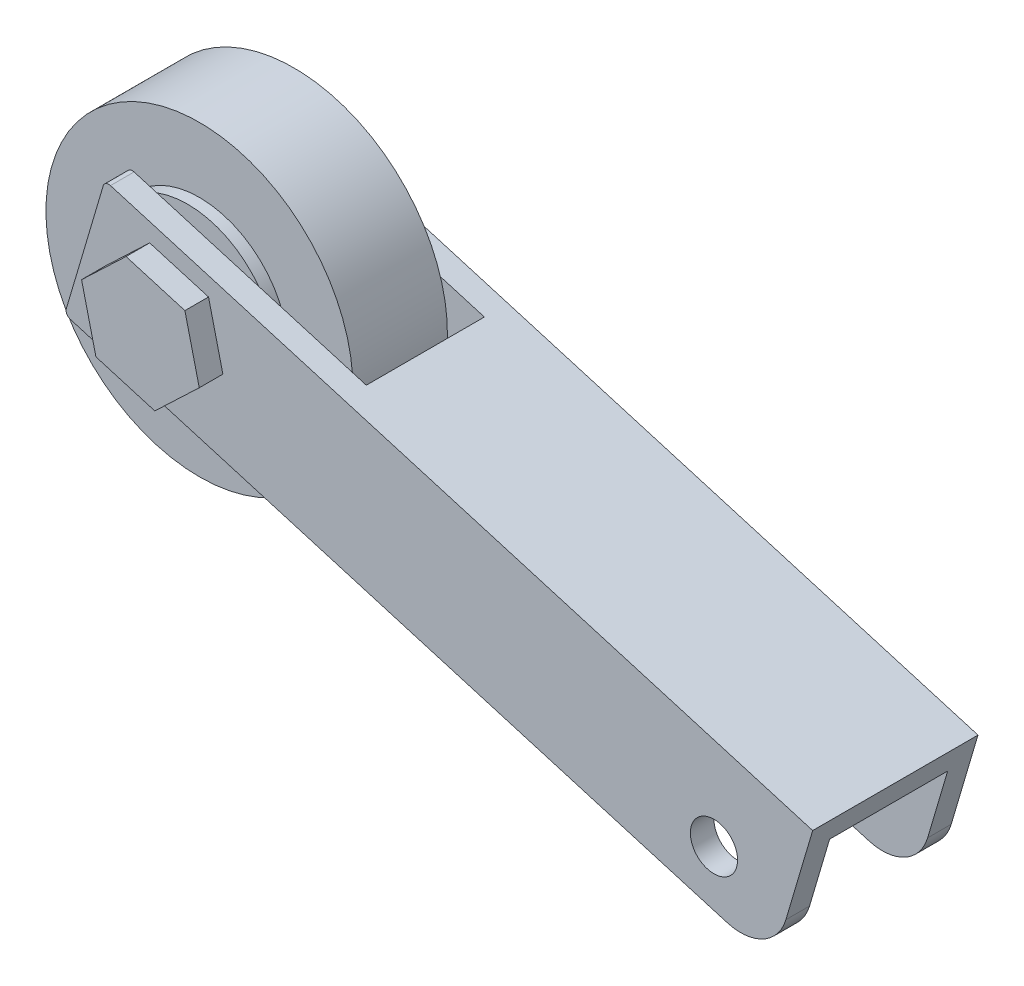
ISO-10303-21;
HEADER;
FILE_DESCRIPTION(('STEP AP214'),'2;1');
FILE_NAME('part.step','',(''),(''),'','','');
FILE_SCHEMA(('AUTOMOTIVE_DESIGN { 1 0 10303 214 1 1 1 1 }'));
ENDSEC;
DATA;
#1=APPLICATION_CONTEXT('core data for automotive mechanical design processes');
#2=APPLICATION_PROTOCOL_DEFINITION('international standard','automotive_design',2000,#1);
#3=PRODUCT_CONTEXT('',#1,'mechanical');
#4=PRODUCT('Part','Part','',(#3));
#5=PRODUCT_RELATED_PRODUCT_CATEGORY('part','',(#4));
#6=PRODUCT_DEFINITION_FORMATION('','',#4);
#7=PRODUCT_DEFINITION_CONTEXT('part definition',#1,'design');
#8=PRODUCT_DEFINITION('design','',#6,#7);
#9=PRODUCT_DEFINITION_SHAPE('','',#8);
#10=(LENGTH_UNIT() NAMED_UNIT(*) SI_UNIT(.MILLI.,.METRE.));
#11=(NAMED_UNIT(*) PLANE_ANGLE_UNIT() SI_UNIT($,.RADIAN.));
#12=(NAMED_UNIT(*) SI_UNIT($,.STERADIAN.) SOLID_ANGLE_UNIT());
#13=UNCERTAINTY_MEASURE_WITH_UNIT(LENGTH_MEASURE(1.E-05),#10,'distance_accuracy_value','');
#14=(GEOMETRIC_REPRESENTATION_CONTEXT(3) GLOBAL_UNCERTAINTY_ASSIGNED_CONTEXT((#13)) GLOBAL_UNIT_ASSIGNED_CONTEXT((#10,
#11,#12)) REPRESENTATION_CONTEXT('',''));
#15=CARTESIAN_POINT('',(0.,0.,0.));
#16=DIRECTION('',(0.,0.,1.));
#17=DIRECTION('',(1.,0.,0.));
#18=AXIS2_PLACEMENT_3D('',#15,#16,#17);
#19=CARTESIAN_POINT('',(-38.2886919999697,86.5613815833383,0.));
#20=DIRECTION('',(-0.283326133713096,-0.959023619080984,0.));
#21=DIRECTION('',(0.,0.,-1.));
#22=AXIS2_PLACEMENT_3D('',#19,#20,#21);
#23=PLANE('',#22);
#24=DIRECTION('',(0.678132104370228,-0.200341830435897,-0.707106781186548));
#25=VECTOR('',#24,1.);
#26=CARTESIAN_POINT('',(-4.48310942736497,76.5741353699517,-2.25));
#27=LINE('',#26,#25);
#28=CARTESIAN_POINT('',(-4.48310942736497,76.5741353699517,-2.25));
#29=VERTEX_POINT('',#28);
#30=CARTESIAN_POINT('',(-3.52408580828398,76.2908092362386,-3.25));
#31=VERTEX_POINT('',#30);
#32=EDGE_CURVE('E548',#29,#31,#27,.T.);
#33=ORIENTED_EDGE('',*,*,#32,.T.);
#34=DIRECTION('',(0.959023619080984,-0.283326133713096,0.));
#35=VECTOR('',#34,1.);
#36=CARTESIAN_POINT('',(-3.52408580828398,76.2908092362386,-3.25));
#37=LINE('',#36,#35);
#38=CARTESIAN_POINT('',(7.98419762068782,72.8908956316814,-3.25));
#39=VERTEX_POINT('',#38);
#40=EDGE_CURVE('E11',#31,#39,#37,.T.);
#41=ORIENTED_EDGE('',*,*,#40,.T.);
#42=DIRECTION('',(0.678132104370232,-0.200341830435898,0.707106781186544));
#43=VECTOR('',#42,1.);
#44=CARTESIAN_POINT('',(7.98419762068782,72.8908956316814,-3.25));
#45=LINE('',#44,#43);
#46=CARTESIAN_POINT('',(8.9432212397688,72.6075694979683,-2.25));
#47=VERTEX_POINT('',#46);
#48=EDGE_CURVE('E430',#39,#47,#45,.T.);
#49=ORIENTED_EDGE('',*,*,#48,.T.);
#50=DIRECTION('',(0.,0.,1.));
#51=VECTOR('',#50,1.);
#52=CARTESIAN_POINT('',(8.9432212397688,72.6075694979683,-2.25));
#53=LINE('',#52,#51);
#54=CARTESIAN_POINT('',(8.94322123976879,72.6075694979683,2.25));
#55=VERTEX_POINT('',#54);
#56=EDGE_CURVE('E480',#47,#55,#53,.T.);
#57=ORIENTED_EDGE('',*,*,#56,.T.);
#58=DIRECTION('',(-0.678132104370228,0.200341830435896,0.707106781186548));
#59=VECTOR('',#58,1.);
#60=CARTESIAN_POINT('',(8.94322123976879,72.6075694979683,2.25));
#61=LINE('',#60,#59);
#62=CARTESIAN_POINT('',(7.98419762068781,72.8908956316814,3.25));
#63=VERTEX_POINT('',#62);
#64=EDGE_CURVE('E391',#55,#63,#61,.T.);
#65=ORIENTED_EDGE('',*,*,#64,.T.);
#66=DIRECTION('',(-0.959023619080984,0.283326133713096,0.));
#67=VECTOR('',#66,1.);
#68=CARTESIAN_POINT('',(7.98419762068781,72.8908956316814,3.25));
#69=LINE('',#68,#67);
#70=CARTESIAN_POINT('',(-3.52408580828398,76.2908092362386,3.25));
#71=VERTEX_POINT('',#70);
#72=EDGE_CURVE('E387',#63,#71,#69,.T.);
#73=ORIENTED_EDGE('',*,*,#72,.T.);
#74=DIRECTION('',(-0.678132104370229,0.200341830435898,-0.707106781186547));
#75=VECTOR('',#74,1.);
#76=CARTESIAN_POINT('',(-3.52408580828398,76.2908092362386,3.25));
#77=LINE('',#76,#75);
#78=CARTESIAN_POINT('',(-4.48310942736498,76.5741353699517,2.25));
#79=VERTEX_POINT('',#78);
#80=EDGE_CURVE('E640',#71,#79,#77,.T.);
#81=ORIENTED_EDGE('',*,*,#80,.T.);
#82=DIRECTION('',(0.,0.,-1.));
#83=VECTOR('',#82,1.);
#84=CARTESIAN_POINT('',(-4.48310942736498,76.5741353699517,2.25));
#85=LINE('',#84,#83);
#86=EDGE_CURVE('E674',#79,#29,#85,.T.);
#87=ORIENTED_EDGE('',*,*,#86,.T.);
#88=EDGE_LOOP('',(#33,#41,#49,#57,#65,#73,#81,#87));
#89=FACE_BOUND('',#88,.T.);
#90=ADVANCED_FACE('F16',(#89),#23,.T.);
#91=CARTESIAN_POINT('',(1.55746729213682,93.4912325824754,-3.25));
#92=DIRECTION('',(0.,0.,-1.));
#93=DIRECTION('',(0.959023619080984,-0.283326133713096,0.));
#94=AXIS2_PLACEMENT_3D('',#91,#92,#93);
#95=PLANE('',#94);
#96=DIRECTION('',(-0.959023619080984,0.283326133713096,0.));
#97=VECTOR('',#96,1.);
#98=CARTESIAN_POINT('',(21.7919472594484,69.3330100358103,-3.25));
#99=LINE('',#98,#97);
#100=CARTESIAN_POINT('',(8.12586068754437,73.3704074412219,-3.25));
#101=VERTEX_POINT('',#100);
#102=CARTESIAN_POINT('',(-3.38242274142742,76.7703210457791,-3.25));
#103=VERTEX_POINT('',#102);
#104=EDGE_CURVE('E755',#101,#103,#99,.T.);
#105=ORIENTED_EDGE('',*,*,#104,.F.);
#106=DIRECTION('',(-0.283326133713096,-0.959023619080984,0.));
#107=VECTOR('',#106,1.);
#108=CARTESIAN_POINT('',(13.0657507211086,90.0913189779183,-3.25));
#109=LINE('',#108,#107);
#110=EDGE_CURVE('E27',#101,#39,#109,.T.);
#111=ORIENTED_EDGE('',*,*,#110,.T.);
#112=ORIENTED_EDGE('',*,*,#40,.F.);
#113=DIRECTION('',(-0.283326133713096,-0.959023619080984,0.));
#114=VECTOR('',#113,1.);
#115=CARTESIAN_POINT('',(1.55746729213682,93.4912325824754,-3.25));
#116=LINE('',#115,#114);
#117=EDGE_CURVE('E544',#103,#31,#116,.T.);
#118=ORIENTED_EDGE('',*,*,#117,.F.);
#119=EDGE_LOOP('',(#105,#111,#112,#118));
#120=FACE_BOUND('',#119,.T.);
#121=ADVANCED_FACE('F980',(#120),#95,.T.);
#122=CARTESIAN_POINT('',(13.0657507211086,90.0913189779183,-3.25));
#123=DIRECTION('',(0.678132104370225,-0.200341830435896,-0.707106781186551));
#124=DIRECTION('',(0.678132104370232,-0.200341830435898,0.707106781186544));
#125=AXIS2_PLACEMENT_3D('',#122,#123,#124);
#126=PLANE('',#125);
#127=DIRECTION('',(-0.678132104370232,0.200341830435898,-0.707106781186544));
#128=VECTOR('',#127,1.);
#129=CARTESIAN_POINT('',(18.9148764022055,70.1829884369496,8.));
#130=LINE('',#129,#128);
#131=CARTESIAN_POINT('',(9.08488430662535,73.0870813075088,-2.25));
#132=VERTEX_POINT('',#131);
#133=EDGE_CURVE('E504',#132,#101,#130,.T.);
#134=ORIENTED_EDGE('',*,*,#133,.F.);
#135=DIRECTION('',(-0.283326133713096,-0.959023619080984,0.));
#136=VECTOR('',#135,1.);
#137=CARTESIAN_POINT('',(14.0247743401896,89.8079928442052,-2.25));
#138=LINE('',#137,#136);
#139=EDGE_CURVE('E433',#132,#47,#138,.T.);
#140=ORIENTED_EDGE('',*,*,#139,.T.);
#141=ORIENTED_EDGE('',*,*,#48,.F.);
#142=ORIENTED_EDGE('',*,*,#110,.F.);
#143=EDGE_LOOP('',(#134,#140,#141,#142));
#144=FACE_BOUND('',#143,.T.);
#145=ADVANCED_FACE('F985',(#144),#126,.T.);
#146=CARTESIAN_POINT('',(14.0247743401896,89.8079928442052,-2.25));
#147=DIRECTION('',(0.959023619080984,-0.283326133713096,0.));
#148=DIRECTION('',(0.283326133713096,0.959023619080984,0.));
#149=AXIS2_PLACEMENT_3D('',#146,#147,#148);
#150=PLANE('',#149);
#151=DIRECTION('',(0.,0.,-1.));
#152=VECTOR('',#151,1.);
#153=CARTESIAN_POINT('',(9.08488430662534,73.0870813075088,5.));
#154=LINE('',#153,#152);
#155=CARTESIAN_POINT('',(9.08488430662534,73.0870813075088,2.25));
#156=VERTEX_POINT('',#155);
#157=EDGE_CURVE('E402',#156,#132,#154,.T.);
#158=ORIENTED_EDGE('',*,*,#157,.F.);
#159=DIRECTION('',(-0.283326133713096,-0.959023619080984,0.));
#160=VECTOR('',#159,1.);
#161=CARTESIAN_POINT('',(14.0247743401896,89.8079928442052,2.25));
#162=LINE('',#161,#160);
#163=EDGE_CURVE('E397',#156,#55,#162,.T.);
#164=ORIENTED_EDGE('',*,*,#163,.T.);
#165=ORIENTED_EDGE('',*,*,#56,.F.);
#166=ORIENTED_EDGE('',*,*,#139,.F.);
#167=EDGE_LOOP('',(#158,#164,#165,#166));
#168=FACE_BOUND('',#167,.T.);
#169=ADVANCED_FACE('F1015',(#168),#150,.T.);
#170=CARTESIAN_POINT('',(14.0247743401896,89.8079928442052,2.25));
#171=DIRECTION('',(0.678132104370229,-0.200341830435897,0.707106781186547));
#172=DIRECTION('',(0.283326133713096,0.959023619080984,0.));
#173=AXIS2_PLACEMENT_3D('',#170,#171,#172);
#174=PLANE('',#173);
#175=DIRECTION('',(0.678132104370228,-0.200341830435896,-0.707106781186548));
#176=VECTOR('',#175,1.);
#177=CARTESIAN_POINT('',(14.1197583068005,71.5996191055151,-3.));
#178=LINE('',#177,#176);
#179=CARTESIAN_POINT('',(8.12586068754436,73.3704074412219,3.25));
#180=VERTEX_POINT('',#179);
#181=EDGE_CURVE('E394',#180,#156,#178,.T.);
#182=ORIENTED_EDGE('',*,*,#181,.F.);
#183=DIRECTION('',(-0.283326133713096,-0.959023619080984,0.));
#184=VECTOR('',#183,1.);
#185=CARTESIAN_POINT('',(13.0657507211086,90.0913189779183,3.25));
#186=LINE('',#185,#184);
#187=EDGE_CURVE('E379',#180,#63,#186,.T.);
#188=ORIENTED_EDGE('',*,*,#187,.T.);
#189=ORIENTED_EDGE('',*,*,#64,.F.);
#190=ORIENTED_EDGE('',*,*,#163,.F.);
#191=EDGE_LOOP('',(#182,#188,#189,#190));
#192=FACE_BOUND('',#191,.T.);
#193=ADVANCED_FACE('F395',(#192),#174,.T.);
#194=CARTESIAN_POINT('',(13.0657507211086,90.0913189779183,3.25));
#195=DIRECTION('',(0.,0.,1.));
#196=DIRECTION('',(-0.959023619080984,0.283326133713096,0.));
#197=AXIS2_PLACEMENT_3D('',#194,#195,#196);
#198=PLANE('',#197);
#199=DIRECTION('',(0.959023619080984,-0.283326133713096,0.));
#200=VECTOR('',#199,1.);
#201=CARTESIAN_POINT('',(21.7919472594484,69.3330100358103,3.25));
#202=LINE('',#201,#200);
#203=CARTESIAN_POINT('',(-3.38242274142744,76.7703210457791,3.25));
#204=VERTEX_POINT('',#203);
#205=EDGE_CURVE('E384',#204,#180,#202,.T.);
#206=ORIENTED_EDGE('',*,*,#205,.F.);
#207=DIRECTION('',(-0.283326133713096,-0.959023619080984,0.));
#208=VECTOR('',#207,1.);
#209=CARTESIAN_POINT('',(1.55746729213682,93.4912325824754,3.25));
#210=LINE('',#209,#208);
#211=EDGE_CURVE('E642',#204,#71,#210,.T.);
#212=ORIENTED_EDGE('',*,*,#211,.T.);
#213=ORIENTED_EDGE('',*,*,#72,.F.);
#214=ORIENTED_EDGE('',*,*,#187,.F.);
#215=EDGE_LOOP('',(#206,#212,#213,#214));
#216=FACE_BOUND('',#215,.T.);
#217=ADVANCED_FACE('F381',(#216),#198,.T.);
#218=CARTESIAN_POINT('',(1.55746729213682,93.4912325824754,3.25));
#219=DIRECTION('',(-0.678132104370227,0.200341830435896,0.707106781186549));
#220=DIRECTION('',(-0.283326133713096,-0.959023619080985,0.));
#221=AXIS2_PLACEMENT_3D('',#218,#219,#220);
#222=PLANE('',#221);
#223=DIRECTION('',(0.67813210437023,-0.200341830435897,0.707106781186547));
#224=VECTOR('',#223,1.);
#225=CARTESIAN_POINT('',(10.0439079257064,72.8037551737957,17.25));
#226=LINE('',#225,#224);
#227=CARTESIAN_POINT('',(-4.34144636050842,77.0536471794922,2.25));
#228=VERTEX_POINT('',#227);
#229=EDGE_CURVE('E408',#228,#204,#226,.T.);
#230=ORIENTED_EDGE('',*,*,#229,.F.);
#231=DIRECTION('',(-0.283326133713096,-0.959023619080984,0.));
#232=VECTOR('',#231,1.);
#233=CARTESIAN_POINT('',(0.598443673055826,93.7745587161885,2.25));
#234=LINE('',#233,#232);
#235=EDGE_CURVE('E643',#228,#79,#234,.T.);
#236=ORIENTED_EDGE('',*,*,#235,.T.);
#237=ORIENTED_EDGE('',*,*,#80,.F.);
#238=ORIENTED_EDGE('',*,*,#211,.F.);
#239=EDGE_LOOP('',(#230,#236,#237,#238));
#240=FACE_BOUND('',#239,.T.);
#241=ADVANCED_FACE('F1001',(#240),#222,.T.);
#242=CARTESIAN_POINT('',(0.598443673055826,93.7745587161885,2.25));
#243=DIRECTION('',(-0.959023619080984,0.283326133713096,0.));
#244=DIRECTION('',(0.,0.,-1.));
#245=AXIS2_PLACEMENT_3D('',#242,#243,#244);
#246=PLANE('',#245);
#247=DIRECTION('',(0.,0.,1.));
#248=VECTOR('',#247,1.);
#249=CARTESIAN_POINT('',(-4.34144636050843,77.0536471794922,5.));
#250=LINE('',#249,#248);
#251=CARTESIAN_POINT('',(-4.34144636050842,77.0536471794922,-2.25));
#252=VERTEX_POINT('',#251);
#253=EDGE_CURVE('E20',#252,#228,#250,.T.);
#254=ORIENTED_EDGE('',*,*,#253,.F.);
#255=DIRECTION('',(-0.283326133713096,-0.959023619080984,0.));
#256=VECTOR('',#255,1.);
#257=CARTESIAN_POINT('',(0.598443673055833,93.7745587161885,-2.25));
#258=LINE('',#257,#256);
#259=EDGE_CURVE('E677',#252,#29,#258,.T.);
#260=ORIENTED_EDGE('',*,*,#259,.T.);
#261=ORIENTED_EDGE('',*,*,#86,.F.);
#262=ORIENTED_EDGE('',*,*,#235,.F.);
#263=EDGE_LOOP('',(#254,#260,#261,#262));
#264=FACE_BOUND('',#263,.T.);
#265=ADVANCED_FACE('F1004',(#264),#246,.T.);
#266=CARTESIAN_POINT('',(0.598443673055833,93.7745587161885,-2.25));
#267=DIRECTION('',(-0.678132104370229,0.200341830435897,-0.707106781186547));
#268=DIRECTION('',(-0.283326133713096,-0.959023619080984,0.));
#269=AXIS2_PLACEMENT_3D('',#266,#267,#268);
#270=PLANE('',#269);
#271=DIRECTION('',(-0.678132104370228,0.200341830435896,0.707106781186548));
#272=VECTOR('',#271,1.);
#273=CARTESIAN_POINT('',(5.24878983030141,74.2203858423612,-12.25));
#274=LINE('',#273,#272);
#275=EDGE_CURVE('E751',#103,#252,#274,.T.);
#276=ORIENTED_EDGE('',*,*,#275,.F.);
#277=ORIENTED_EDGE('',*,*,#117,.T.);
#278=ORIENTED_EDGE('',*,*,#32,.F.);
#279=ORIENTED_EDGE('',*,*,#259,.F.);
#280=EDGE_LOOP('',(#276,#277,#278,#279));
#281=FACE_BOUND('',#280,.T.);
#282=ADVANCED_FACE('F999',(#281),#270,.T.);
#283=CARTESIAN_POINT('',(-32.5671681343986,81.2215159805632,-4.));
#284=DIRECTION('',(0.,0.,-1.));
#285=DIRECTION('',(0.959023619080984,-0.283326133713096,0.));
#286=AXIS2_PLACEMENT_3D('',#283,#284,#285);
#287=PLANE('',#286);
#288=CARTESIAN_POINT('',(-32.5671681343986,81.2215159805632,-4.));
#289=DIRECTION('',(0.,0.,-1.));
#290=DIRECTION('',(-0.283326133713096,-0.959023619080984,0.));
#291=AXIS2_PLACEMENT_3D('',#288,#289,#290);
#292=CIRCLE('',#291,7.5);
#293=CARTESIAN_POINT('',(-25.0895879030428,81.800993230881,-4.));
#294=VERTEX_POINT('',#293);
#295=EDGE_CURVE('E715',#294,#294,#292,.T.);
#296=ORIENTED_EDGE('',*,*,#295,.F.);
#297=EDGE_LOOP('',(#296));
#298=FACE_BOUND('',#297,.T.);
#299=CARTESIAN_POINT('',(-32.5671681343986,81.2215159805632,-4.));
#300=DIRECTION('',(0.,0.,-1.));
#301=DIRECTION('',(-0.283326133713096,-0.959023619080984,0.));
#302=AXIS2_PLACEMENT_3D('',#299,#300,#301);
#303=CIRCLE('',#302,13.);
#304=CARTESIAN_POINT('',(-19.6060290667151,82.2259432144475,-4.));
#305=VERTEX_POINT('',#304);
#306=EDGE_CURVE('E695',#305,#305,#303,.T.);
#307=ORIENTED_EDGE('',*,*,#306,.T.);
#308=EDGE_LOOP('',(#307));
#309=FACE_BOUND('',#308,.T.);
#310=ADVANCED_FACE('F995',(#298,#309),#287,.T.);
#311=CARTESIAN_POINT('',(-32.5671681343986,81.2215159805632,4.));
#312=DIRECTION('',(0.,0.,-1.));
#313=DIRECTION('',(0.959023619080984,-0.283326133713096,0.));
#314=AXIS2_PLACEMENT_3D('',#311,#312,#313);
#315=PLANE('',#314);
#316=CARTESIAN_POINT('',(-32.5671681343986,81.2215159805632,4.));
#317=DIRECTION('',(0.,0.,-1.));
#318=DIRECTION('',(-0.283326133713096,-0.959023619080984,0.));
#319=AXIS2_PLACEMENT_3D('',#316,#317,#318);
#320=CIRCLE('',#319,7.5);
#321=CARTESIAN_POINT('',(-25.0895879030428,81.800993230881,4.));
#322=VERTEX_POINT('',#321);
#323=EDGE_CURVE('E529',#322,#322,#320,.T.);
#324=ORIENTED_EDGE('',*,*,#323,.T.);
#325=EDGE_LOOP('',(#324));
#326=FACE_BOUND('',#325,.T.);
#327=CARTESIAN_POINT('',(-32.5671681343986,81.2215159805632,4.));
#328=DIRECTION('',(0.,0.,1.));
#329=DIRECTION('',(-0.283326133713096,-0.959023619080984,0.));
#330=AXIS2_PLACEMENT_3D('',#327,#328,#329);
#331=CIRCLE('',#330,13.);
#332=CARTESIAN_POINT('',(-19.6060290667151,82.2259432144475,4.));
#333=VERTEX_POINT('',#332);
#334=EDGE_CURVE('E601',#333,#333,#331,.T.);
#335=ORIENTED_EDGE('',*,*,#334,.T.);
#336=EDGE_LOOP('',(#335));
#337=FACE_BOUND('',#336,.T.);
#338=ADVANCED_FACE('F998',(#326,#337),#315,.F.);
#339=CARTESIAN_POINT('',(-32.5671681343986,81.2215159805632,-5.));
#340=DIRECTION('',(0.,0.,-1.));
#341=DIRECTION('',(0.959023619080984,-0.283326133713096,0.));
#342=AXIS2_PLACEMENT_3D('',#339,#340,#341);
#343=PLANE('',#342);
#344=DIRECTION('',(0.283326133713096,0.959023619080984,0.));
#345=VECTOR('',#344,1.);
#346=CARTESIAN_POINT('',(-40.9802902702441,77.4506572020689,-5.));
#347=LINE('',#346,#345);
#348=CARTESIAN_POINT('',(-40.0432124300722,80.622548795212,-5.));
#349=VERTEX_POINT('',#348);
#350=CARTESIAN_POINT('',(-38.5174545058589,85.7870490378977,-5.));
#351=VERTEX_POINT('',#350);
#352=EDGE_CURVE('E522',#349,#351,#347,.T.);
#353=ORIENTED_EDGE('',*,*,#352,.F.);
#354=CARTESIAN_POINT('',(-32.5671681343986,81.2215159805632,-5.));
#355=DIRECTION('',(0.,0.,-1.));
#356=DIRECTION('',(-0.997010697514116,-0.0772636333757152,0.));
#357=AXIS2_PLACEMENT_3D('',#354,#355,#356);
#358=CIRCLE('',#357,7.5);
#359=EDGE_CURVE('E448',#349,#351,#358,.T.);
#360=ORIENTED_EDGE('',*,*,#359,.T.);
#361=EDGE_LOOP('',(#353,#360));
#362=FACE_BOUND('',#361,.T.);
#363=ADVANCED_FACE('F1013',(#362),#343,.T.);
#364=CARTESIAN_POINT('',(-32.5671681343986,81.2215159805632,-5.));
#365=DIRECTION('',(0.,0.,-1.));
#366=DIRECTION('',(0.959023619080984,-0.283326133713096,0.));
#367=AXIS2_PLACEMENT_3D('',#364,#365,#366);
#368=PLANE('',#367);
#369=DIRECTION('',(0.959023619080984,-0.283326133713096,0.));
#370=VECTOR('',#369,1.);
#371=CARTESIAN_POINT('',(22.3585995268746,71.2510572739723,-5.));
#372=LINE('',#371,#370);
#373=CARTESIAN_POINT('',(-35.1828176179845,88.250625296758,-5.));
#374=VERTEX_POINT('',#373);
#375=CARTESIAN_POINT('',(-26.5516050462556,85.7006900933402,-5.));
#376=VERTEX_POINT('',#375);
#377=EDGE_CURVE('E670',#374,#376,#372,.T.);
#378=ORIENTED_EDGE('',*,*,#377,.F.);
#379=CARTESIAN_POINT('',(-32.5671681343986,81.2215159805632,-5.));
#380=DIRECTION('',(0.,0.,-1.));
#381=DIRECTION('',(-0.997010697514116,-0.0772636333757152,0.));
#382=AXIS2_PLACEMENT_3D('',#379,#380,#381);
#383=CIRCLE('',#382,7.5);
#384=EDGE_CURVE('E449',#374,#376,#383,.T.);
#385=ORIENTED_EDGE('',*,*,#384,.T.);
#386=EDGE_LOOP('',(#378,#385));
#387=FACE_BOUND('',#386,.T.);
#388=ADVANCED_FACE('F1009',(#387),#368,.T.);
#389=CARTESIAN_POINT('',(-32.5671681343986,81.2215159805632,-5.));
#390=DIRECTION('',(0.,0.,-1.));
#391=DIRECTION('',(0.959023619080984,-0.283326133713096,0.));
#392=AXIS2_PLACEMENT_3D('',#389,#390,#391);
#393=PLANE('',#392);
#394=DIRECTION('',(-0.959023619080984,0.283326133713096,0.));
#395=VECTOR('',#394,1.);
#396=CARTESIAN_POINT('',(18.9586859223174,59.7427738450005,-5.));
#397=LINE('',#396,#395);
#398=CARTESIAN_POINT('',(-29.9515186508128,74.1924066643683,-5.));
#399=VERTEX_POINT('',#398);
#400=CARTESIAN_POINT('',(-38.5827312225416,76.7423418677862,-5.));
#401=VERTEX_POINT('',#400);
#402=EDGE_CURVE('E622',#399,#401,#397,.T.);
#403=ORIENTED_EDGE('',*,*,#402,.F.);
#404=CARTESIAN_POINT('',(-32.5671681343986,81.2215159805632,-5.));
#405=DIRECTION('',(0.,0.,-1.));
#406=DIRECTION('',(-0.997010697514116,-0.0772636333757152,0.));
#407=AXIS2_PLACEMENT_3D('',#404,#405,#406);
#408=CIRCLE('',#407,7.5);
#409=EDGE_CURVE('E865',#399,#401,#408,.T.);
#410=ORIENTED_EDGE('',*,*,#409,.T.);
#411=EDGE_LOOP('',(#403,#410));
#412=FACE_BOUND('',#411,.T.);
#413=ADVANCED_FACE('F1012',(#412),#393,.T.);
#414=CARTESIAN_POINT('',(-32.5671681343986,81.2215159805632,5.));
#415=DIRECTION('',(0.,0.,-1.));
#416=DIRECTION('',(0.959023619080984,-0.283326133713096,0.));
#417=AXIS2_PLACEMENT_3D('',#414,#415,#416);
#418=PLANE('',#417);
#419=CARTESIAN_POINT('',(-32.5671681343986,81.2215159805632,5.));
#420=DIRECTION('',(0.,0.,-1.));
#421=DIRECTION('',(-0.997010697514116,-0.0772636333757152,0.));
#422=AXIS2_PLACEMENT_3D('',#419,#420,#421);
#423=CIRCLE('',#422,7.5);
#424=CARTESIAN_POINT('',(-35.1828176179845,88.250625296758,5.));
#425=VERTEX_POINT('',#424);
#426=CARTESIAN_POINT('',(-26.5516050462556,85.7006900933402,5.));
#427=VERTEX_POINT('',#426);
#428=EDGE_CURVE('E516',#425,#427,#423,.T.);
#429=ORIENTED_EDGE('',*,*,#428,.F.);
#430=DIRECTION('',(0.959023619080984,-0.283326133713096,0.));
#431=VECTOR('',#430,1.);
#432=CARTESIAN_POINT('',(22.3585995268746,71.2510572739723,5.));
#433=LINE('',#432,#431);
#434=EDGE_CURVE('E685',#425,#427,#433,.T.);
#435=ORIENTED_EDGE('',*,*,#434,.T.);
#436=EDGE_LOOP('',(#429,#435));
#437=FACE_BOUND('',#436,.T.);
#438=ADVANCED_FACE('F1008',(#437),#418,.F.);
#439=CARTESIAN_POINT('',(-32.5671681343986,81.2215159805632,5.));
#440=DIRECTION('',(0.,0.,-1.));
#441=DIRECTION('',(0.959023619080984,-0.283326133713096,0.));
#442=AXIS2_PLACEMENT_3D('',#439,#440,#441);
#443=PLANE('',#442);
#444=CARTESIAN_POINT('',(-32.5671681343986,81.2215159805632,5.));
#445=DIRECTION('',(0.,0.,-1.));
#446=DIRECTION('',(-0.997010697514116,-0.0772636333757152,0.));
#447=AXIS2_PLACEMENT_3D('',#444,#445,#446);
#448=CIRCLE('',#447,7.5);
#449=CARTESIAN_POINT('',(-29.9515186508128,74.1924066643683,5.));
#450=VERTEX_POINT('',#449);
#451=CARTESIAN_POINT('',(-38.5827312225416,76.7423418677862,5.));
#452=VERTEX_POINT('',#451);
#453=EDGE_CURVE('E573',#450,#452,#448,.T.);
#454=ORIENTED_EDGE('',*,*,#453,.F.);
#455=DIRECTION('',(-0.959023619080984,0.283326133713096,0.));
#456=VECTOR('',#455,1.);
#457=CARTESIAN_POINT('',(18.9586859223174,59.7427738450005,5.));
#458=LINE('',#457,#456);
#459=EDGE_CURVE('E669',#450,#452,#458,.T.);
#460=ORIENTED_EDGE('',*,*,#459,.T.);
#461=EDGE_LOOP('',(#454,#460));
#462=FACE_BOUND('',#461,.T.);
#463=ADVANCED_FACE('F905',(#462),#443,.F.);
#464=CARTESIAN_POINT('',(-32.5671681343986,81.2215159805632,5.));
#465=DIRECTION('',(0.,0.,-1.));
#466=DIRECTION('',(0.959023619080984,-0.283326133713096,0.));
#467=AXIS2_PLACEMENT_3D('',#464,#465,#466);
#468=PLANE('',#467);
#469=CARTESIAN_POINT('',(-32.5671681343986,81.2215159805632,5.));
#470=DIRECTION('',(0.,0.,-1.));
#471=DIRECTION('',(-0.997010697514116,-0.0772636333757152,0.));
#472=AXIS2_PLACEMENT_3D('',#469,#470,#471);
#473=CIRCLE('',#472,7.5);
#474=CARTESIAN_POINT('',(-40.0432124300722,80.622548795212,5.));
#475=VERTEX_POINT('',#474);
#476=CARTESIAN_POINT('',(-38.5174545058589,85.7870490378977,5.));
#477=VERTEX_POINT('',#476);
#478=EDGE_CURVE('E783',#475,#477,#473,.T.);
#479=ORIENTED_EDGE('',*,*,#478,.F.);
#480=DIRECTION('',(0.283326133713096,0.959023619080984,0.));
#481=VECTOR('',#480,1.);
#482=CARTESIAN_POINT('',(-40.9802902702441,77.4506572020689,5.));
#483=LINE('',#482,#481);
#484=EDGE_CURVE('E634',#475,#477,#483,.T.);
#485=ORIENTED_EDGE('',*,*,#484,.T.);
#486=EDGE_LOOP('',(#479,#485));
#487=FACE_BOUND('',#486,.T.);
#488=ADVANCED_FACE('F922',(#487),#468,.F.);
#489=CARTESIAN_POINT('',(-37.5504010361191,82.6937217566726,-7.));
#490=DIRECTION('',(-0.688875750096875,0.72487943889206,0.));
#491=DIRECTION('',(0.,0.,-1.));
#492=AXIS2_PLACEMENT_3D('',#489,#490,#491);
#493=PLANE('',#492);
#494=DIRECTION('',(0.,0.,-1.));
#495=VECTOR('',#494,1.);
#496=CARTESIAN_POINT('',(-33.78381698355,86.2732251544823,-7.));
#497=LINE('',#496,#495);
#498=CARTESIAN_POINT('',(-33.78381698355,86.2732251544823,9.));
#499=VERTEX_POINT('',#498);
#500=CARTESIAN_POINT('',(-33.78381698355,86.2732251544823,7.));
#501=VERTEX_POINT('',#500);
#502=EDGE_CURVE('E476',#499,#501,#497,.T.);
#503=ORIENTED_EDGE('',*,*,#502,.T.);
#504=DIRECTION('',(-0.72487943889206,-0.688875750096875,0.));
#505=VECTOR('',#504,1.);
#506=CARTESIAN_POINT('',(-37.5504010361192,82.6937217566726,7.));
#507=LINE('',#506,#505);
#508=CARTESIAN_POINT('',(-37.5504010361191,82.6937217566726,7.));
#509=VERTEX_POINT('',#508);
#510=EDGE_CURVE('E629',#501,#509,#507,.T.);
#511=ORIENTED_EDGE('',*,*,#510,.T.);
#512=DIRECTION('',(0.,0.,-1.));
#513=VECTOR('',#512,1.);
#514=CARTESIAN_POINT('',(-37.5504010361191,82.6937217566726,-7.));
#515=LINE('',#514,#513);
#516=CARTESIAN_POINT('',(-37.5504010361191,82.6937217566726,9.));
#517=VERTEX_POINT('',#516);
#518=EDGE_CURVE('E549',#517,#509,#515,.T.);
#519=ORIENTED_EDGE('',*,*,#518,.F.);
#520=DIRECTION('',(0.72487943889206,0.688875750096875,0.));
#521=VECTOR('',#520,1.);
#522=CARTESIAN_POINT('',(-37.5504010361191,82.6937217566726,9.));
#523=LINE('',#522,#521);
#524=EDGE_CURVE('E581',#517,#499,#523,.T.);
#525=ORIENTED_EDGE('',*,*,#524,.T.);
#526=EDGE_LOOP('',(#503,#511,#519,#525));
#527=FACE_BOUND('',#526,.T.);
#528=ADVANCED_FACE('F1027',(#527),#493,.T.);
#529=CARTESIAN_POINT('',(-36.3337521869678,77.6420125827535,-7.));
#530=DIRECTION('',(-0.972201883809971,-0.234144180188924,0.));
#531=DIRECTION('',(0.,0.,-1.));
#532=AXIS2_PLACEMENT_3D('',#529,#530,#531);
#533=PLANE('',#532);
#534=ORIENTED_EDGE('',*,*,#518,.T.);
#535=DIRECTION('',(0.234144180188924,-0.972201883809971,0.));
#536=VECTOR('',#535,1.);
#537=CARTESIAN_POINT('',(-36.3337521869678,77.6420125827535,7.));
#538=LINE('',#537,#536);
#539=CARTESIAN_POINT('',(-36.3337521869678,77.6420125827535,7.));
#540=VERTEX_POINT('',#539);
#541=EDGE_CURVE('E568',#509,#540,#538,.T.);
#542=ORIENTED_EDGE('',*,*,#541,.T.);
#543=DIRECTION('',(0.,0.,-1.));
#544=VECTOR('',#543,1.);
#545=CARTESIAN_POINT('',(-36.3337521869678,77.6420125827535,-7.));
#546=LINE('',#545,#544);
#547=CARTESIAN_POINT('',(-36.3337521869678,77.6420125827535,9.));
#548=VERTEX_POINT('',#547);
#549=EDGE_CURVE('E550',#548,#540,#546,.T.);
#550=ORIENTED_EDGE('',*,*,#549,.F.);
#551=DIRECTION('',(-0.234144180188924,0.972201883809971,0.));
#552=VECTOR('',#551,1.);
#553=CARTESIAN_POINT('',(-36.3337521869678,77.6420125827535,9.));
#554=LINE('',#553,#552);
#555=EDGE_CURVE('E429',#548,#517,#554,.T.);
#556=ORIENTED_EDGE('',*,*,#555,.T.);
#557=EDGE_LOOP('',(#534,#542,#550,#556));
#558=FACE_BOUND('',#557,.T.);
#559=ADVANCED_FACE('F1363',(#558),#533,.T.);
#560=CARTESIAN_POINT('',(-31.3505192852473,76.1698068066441,-7.));
#561=DIRECTION('',(-0.283326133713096,-0.959023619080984,0.));
#562=DIRECTION('',(0.959023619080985,-0.283326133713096,0.));
#563=AXIS2_PLACEMENT_3D('',#560,#561,#562);
#564=PLANE('',#563);
#565=ORIENTED_EDGE('',*,*,#549,.T.);
#566=DIRECTION('',(0.959023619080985,-0.283326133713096,0.));
#567=VECTOR('',#566,1.);
#568=CARTESIAN_POINT('',(-31.3505192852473,76.1698068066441,7.));
#569=LINE('',#568,#567);
#570=CARTESIAN_POINT('',(-31.3505192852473,76.1698068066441,7.));
#571=VERTEX_POINT('',#570);
#572=EDGE_CURVE('E572',#540,#571,#569,.T.);
#573=ORIENTED_EDGE('',*,*,#572,.T.);
#574=DIRECTION('',(0.,0.,-1.));
#575=VECTOR('',#574,1.);
#576=CARTESIAN_POINT('',(-31.3505192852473,76.1698068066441,-7.));
#577=LINE('',#576,#575);
#578=CARTESIAN_POINT('',(-31.3505192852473,76.1698068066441,9.));
#579=VERTEX_POINT('',#578);
#580=EDGE_CURVE('E553',#579,#571,#577,.T.);
#581=ORIENTED_EDGE('',*,*,#580,.F.);
#582=DIRECTION('',(-0.959023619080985,0.283326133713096,0.));
#583=VECTOR('',#582,1.);
#584=CARTESIAN_POINT('',(-31.3505192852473,76.1698068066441,9.));
#585=LINE('',#584,#583);
#586=EDGE_CURVE('E424',#579,#548,#585,.T.);
#587=ORIENTED_EDGE('',*,*,#586,.T.);
#588=EDGE_LOOP('',(#565,#573,#581,#587));
#589=FACE_BOUND('',#588,.T.);
#590=ADVANCED_FACE('F1052',(#589),#564,.T.);
#591=CARTESIAN_POINT('',(-27.5839352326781,79.7493102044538,-7.));
#592=DIRECTION('',(0.688875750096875,-0.72487943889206,0.));
#593=DIRECTION('',(0.72487943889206,0.688875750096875,0.));
#594=AXIS2_PLACEMENT_3D('',#591,#592,#593);
#595=PLANE('',#594);
#596=ORIENTED_EDGE('',*,*,#580,.T.);
#597=DIRECTION('',(0.72487943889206,0.688875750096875,0.));
#598=VECTOR('',#597,1.);
#599=CARTESIAN_POINT('',(-27.5839352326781,79.7493102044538,7.));
#600=LINE('',#599,#598);
#601=CARTESIAN_POINT('',(-27.5839352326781,79.7493102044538,7.));
#602=VERTEX_POINT('',#601);
#603=EDGE_CURVE('E869',#571,#602,#600,.T.);
#604=ORIENTED_EDGE('',*,*,#603,.T.);
#605=DIRECTION('',(0.,0.,-1.));
#606=VECTOR('',#605,1.);
#607=CARTESIAN_POINT('',(-27.5839352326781,79.7493102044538,-7.));
#608=LINE('',#607,#606);
#609=CARTESIAN_POINT('',(-27.5839352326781,79.7493102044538,9.));
#610=VERTEX_POINT('',#609);
#611=EDGE_CURVE('E654',#610,#602,#608,.T.);
#612=ORIENTED_EDGE('',*,*,#611,.F.);
#613=DIRECTION('',(-0.72487943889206,-0.688875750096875,0.));
#614=VECTOR('',#613,1.);
#615=CARTESIAN_POINT('',(-27.5839352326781,79.7493102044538,9.));
#616=LINE('',#615,#614);
#617=EDGE_CURVE('E428',#610,#579,#616,.T.);
#618=ORIENTED_EDGE('',*,*,#617,.T.);
#619=EDGE_LOOP('',(#596,#604,#612,#618));
#620=FACE_BOUND('',#619,.T.);
#621=ADVANCED_FACE('F1049',(#620),#595,.T.);
#622=CARTESIAN_POINT('',(-28.8005840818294,84.8010193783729,-7.));
#623=DIRECTION('',(0.972201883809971,0.234144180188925,0.));
#624=DIRECTION('',(0.,0.,1.));
#625=AXIS2_PLACEMENT_3D('',#622,#623,#624);
#626=PLANE('',#625);
#627=ORIENTED_EDGE('',*,*,#611,.T.);
#628=DIRECTION('',(-0.234144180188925,0.972201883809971,0.));
#629=VECTOR('',#628,1.);
#630=CARTESIAN_POINT('',(-28.8005840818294,84.8010193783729,7.));
#631=LINE('',#630,#629);
#632=CARTESIAN_POINT('',(-28.8005840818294,84.8010193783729,7.));
#633=VERTEX_POINT('',#632);
#634=EDGE_CURVE('E885',#602,#633,#631,.T.);
#635=ORIENTED_EDGE('',*,*,#634,.T.);
#636=DIRECTION('',(0.,0.,-1.));
#637=VECTOR('',#636,1.);
#638=CARTESIAN_POINT('',(-28.8005840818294,84.8010193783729,-7.));
#639=LINE('',#638,#637);
#640=CARTESIAN_POINT('',(-28.8005840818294,84.8010193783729,9.));
#641=VERTEX_POINT('',#640);
#642=EDGE_CURVE('E473',#641,#633,#639,.T.);
#643=ORIENTED_EDGE('',*,*,#642,.F.);
#644=DIRECTION('',(0.234144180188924,-0.972201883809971,0.));
#645=VECTOR('',#644,1.);
#646=CARTESIAN_POINT('',(-28.8005840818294,84.8010193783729,9.));
#647=LINE('',#646,#645);
#648=EDGE_CURVE('E809',#641,#610,#647,.T.);
#649=ORIENTED_EDGE('',*,*,#648,.T.);
#650=EDGE_LOOP('',(#627,#635,#643,#649));
#651=FACE_BOUND('',#650,.T.);
#652=ADVANCED_FACE('F1045',(#651),#626,.T.);
#653=CARTESIAN_POINT('',(-33.78381698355,86.2732251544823,-7.));
#654=DIRECTION('',(0.283326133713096,0.959023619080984,0.));
#655=DIRECTION('',(-0.959023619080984,0.283326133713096,0.));
#656=AXIS2_PLACEMENT_3D('',#653,#654,#655);
#657=PLANE('',#656);
#658=ORIENTED_EDGE('',*,*,#642,.T.);
#659=DIRECTION('',(-0.959023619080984,0.283326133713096,0.));
#660=VECTOR('',#659,1.);
#661=CARTESIAN_POINT('',(-33.78381698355,86.2732251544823,7.));
#662=LINE('',#661,#660);
#663=EDGE_CURVE('E742',#633,#501,#662,.T.);
#664=ORIENTED_EDGE('',*,*,#663,.T.);
#665=ORIENTED_EDGE('',*,*,#502,.F.);
#666=DIRECTION('',(0.959023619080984,-0.283326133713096,0.));
#667=VECTOR('',#666,1.);
#668=CARTESIAN_POINT('',(-33.78381698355,86.2732251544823,9.));
#669=LINE('',#668,#667);
#670=EDGE_CURVE('E813',#499,#641,#669,.T.);
#671=ORIENTED_EDGE('',*,*,#670,.T.);
#672=EDGE_LOOP('',(#658,#664,#665,#671));
#673=FACE_BOUND('',#672,.T.);
#674=ADVANCED_FACE('F1048',(#673),#657,.T.);
#675=CARTESIAN_POINT('',(-32.5671681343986,81.2215159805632,9.));
#676=DIRECTION('',(0.,0.,1.));
#677=DIRECTION('',(-0.283326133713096,-0.959023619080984,0.));
#678=AXIS2_PLACEMENT_3D('',#675,#676,#677);
#679=PLANE('',#678);
#680=ORIENTED_EDGE('',*,*,#648,.F.);
#681=ORIENTED_EDGE('',*,*,#670,.F.);
#682=ORIENTED_EDGE('',*,*,#524,.F.);
#683=ORIENTED_EDGE('',*,*,#555,.F.);
#684=ORIENTED_EDGE('',*,*,#586,.F.);
#685=ORIENTED_EDGE('',*,*,#617,.F.);
#686=EDGE_LOOP('',(#680,#681,#682,#683,#684,#685));
#687=FACE_BOUND('',#686,.T.);
#688=ADVANCED_FACE('F1400',(#687),#679,.T.);
#689=CARTESIAN_POINT('',(-37.242527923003,88.3377657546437,-7.));
#690=DIRECTION('',(0.,0.,1.));
#691=DIRECTION('',(-0.283326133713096,-0.959023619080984,0.));
#692=AXIS2_PLACEMENT_3D('',#689,#690,#691);
#693=CYLINDRICAL_SURFACE('',#692,0.5);
#694=CARTESIAN_POINT('',(-37.242527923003,88.3377657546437,5.));
#695=DIRECTION('',(0.,0.,-1.));
#696=DIRECTION('',(0.959023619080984,-0.283326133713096,0.));
#697=AXIS2_PLACEMENT_3D('',#694,#695,#696);
#698=CIRCLE('',#697,0.5);
#699=CARTESIAN_POINT('',(-37.7220397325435,88.4794288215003,5.));
#700=VERTEX_POINT('',#699);
#701=CARTESIAN_POINT('',(-37.1008648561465,88.8172775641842,5.));
#702=VERTEX_POINT('',#701);
#703=EDGE_CURVE('E750',#700,#702,#698,.T.);
#704=ORIENTED_EDGE('',*,*,#703,.F.);
#705=DIRECTION('',(0.,0.,-1.));
#706=VECTOR('',#705,1.);
#707=CARTESIAN_POINT('',(-37.7220397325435,88.4794288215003,0.));
#708=LINE('',#707,#706);
#709=CARTESIAN_POINT('',(-37.7220397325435,88.4794288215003,7.));
#710=VERTEX_POINT('',#709);
#711=EDGE_CURVE('E639',#710,#700,#708,.T.);
#712=ORIENTED_EDGE('',*,*,#711,.F.);
#713=CARTESIAN_POINT('',(-37.242527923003,88.3377657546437,7.));
#714=DIRECTION('',(0.,0.,1.));
#715=DIRECTION('',(0.283326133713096,0.959023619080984,0.));
#716=AXIS2_PLACEMENT_3D('',#713,#714,#715);
#717=CIRCLE('',#716,0.5);
#718=CARTESIAN_POINT('',(-37.1008648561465,88.8172775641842,7.));
#719=VERTEX_POINT('',#718);
#720=EDGE_CURVE('E626',#719,#710,#717,.T.);
#721=ORIENTED_EDGE('',*,*,#720,.F.);
#722=DIRECTION('',(0.,0.,1.));
#723=VECTOR('',#722,1.);
#724=CARTESIAN_POINT('',(-37.1008648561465,88.8172775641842,-7.));
#725=LINE('',#724,#723);
#726=EDGE_CURVE('E510',#702,#719,#725,.T.);
#727=ORIENTED_EDGE('',*,*,#726,.F.);
#728=EDGE_LOOP('',(#704,#712,#721,#727));
#729=FACE_BOUND('',#728,.T.);
#730=ADVANCED_FACE('F1432',(#729),#693,.T.);
#731=CARTESIAN_POINT('',(-37.242527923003,88.3377657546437,-7.));
#732=DIRECTION('',(0.,0.,1.));
#733=DIRECTION('',(-0.283326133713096,-0.959023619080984,0.));
#734=AXIS2_PLACEMENT_3D('',#731,#732,#733);
#735=CYLINDRICAL_SURFACE('',#734,0.5);
#736=CARTESIAN_POINT('',(-37.242527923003,88.3377657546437,-7.));
#737=DIRECTION('',(0.,0.,-1.));
#738=DIRECTION('',(-0.283326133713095,-0.959023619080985,0.));
#739=AXIS2_PLACEMENT_3D('',#736,#737,#738);
#740=CIRCLE('',#739,0.5);
#741=CARTESIAN_POINT('',(-37.7220397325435,88.4794288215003,-7.));
#742=VERTEX_POINT('',#741);
#743=CARTESIAN_POINT('',(-37.1008648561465,88.8172775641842,-7.));
#744=VERTEX_POINT('',#743);
#745=EDGE_CURVE('E586',#742,#744,#740,.T.);
#746=ORIENTED_EDGE('',*,*,#745,.F.);
#747=DIRECTION('',(0.,0.,-1.));
#748=VECTOR('',#747,1.);
#749=CARTESIAN_POINT('',(-37.7220397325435,88.4794288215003,0.));
#750=LINE('',#749,#748);
#751=CARTESIAN_POINT('',(-37.7220397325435,88.4794288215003,-5.));
#752=VERTEX_POINT('',#751);
#753=EDGE_CURVE('E814',#752,#742,#750,.T.);
#754=ORIENTED_EDGE('',*,*,#753,.F.);
#755=CARTESIAN_POINT('',(-37.242527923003,88.3377657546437,-5.));
#756=DIRECTION('',(0.,0.,1.));
#757=DIRECTION('',(0.283326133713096,0.959023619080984,0.));
#758=AXIS2_PLACEMENT_3D('',#755,#756,#757);
#759=CIRCLE('',#758,0.5);
#760=CARTESIAN_POINT('',(-37.1008648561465,88.8172775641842,-5.));
#761=VERTEX_POINT('',#760);
#762=EDGE_CURVE('E498',#761,#752,#759,.T.);
#763=ORIENTED_EDGE('',*,*,#762,.F.);
#764=DIRECTION('',(0.,0.,1.));
#765=VECTOR('',#764,1.);
#766=CARTESIAN_POINT('',(-37.1008648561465,88.8172775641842,-7.));
#767=LINE('',#766,#765);
#768=EDGE_CURVE('E666',#744,#761,#767,.T.);
#769=ORIENTED_EDGE('',*,*,#768,.F.);
#770=EDGE_LOOP('',(#746,#754,#763,#769));
#771=FACE_BOUND('',#770,.T.);
#772=ADVANCED_FACE('F1436',(#771),#735,.T.);
#773=CARTESIAN_POINT('',(-40.359115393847,77.7885059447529,-5.));
#774=DIRECTION('',(0.,0.,-1.));
#775=DIRECTION('',(-0.959023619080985,0.283326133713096,0.));
#776=AXIS2_PLACEMENT_3D('',#773,#774,#775);
#777=CYLINDRICAL_SURFACE('',#776,0.5);
#778=CARTESIAN_POINT('',(-40.359115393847,77.7885059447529,-5.));
#779=DIRECTION('',(0.,0.,1.));
#780=DIRECTION('',(0.283326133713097,0.959023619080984,0.));
#781=AXIS2_PLACEMENT_3D('',#778,#779,#780);
#782=CIRCLE('',#781,0.5);
#783=CARTESIAN_POINT('',(-40.8386272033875,77.9301690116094,-5.));
#784=VERTEX_POINT('',#783);
#785=CARTESIAN_POINT('',(-40.5007784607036,77.3089941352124,-5.));
#786=VERTEX_POINT('',#785);
#787=EDGE_CURVE('E503',#784,#786,#782,.T.);
#788=ORIENTED_EDGE('',*,*,#787,.F.);
#789=DIRECTION('',(0.,0.,1.));
#790=VECTOR('',#789,1.);
#791=CARTESIAN_POINT('',(-40.8386272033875,77.9301690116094,0.));
#792=LINE('',#791,#790);
#793=CARTESIAN_POINT('',(-40.8386272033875,77.9301690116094,-7.));
#794=VERTEX_POINT('',#793);
#795=EDGE_CURVE('E519',#794,#784,#792,.T.);
#796=ORIENTED_EDGE('',*,*,#795,.F.);
#797=CARTESIAN_POINT('',(-40.359115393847,77.7885059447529,-7.));
#798=DIRECTION('',(0.,0.,-1.));
#799=DIRECTION('',(-0.283326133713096,-0.959023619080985,0.));
#800=AXIS2_PLACEMENT_3D('',#797,#798,#799);
#801=CIRCLE('',#800,0.5);
#802=CARTESIAN_POINT('',(-40.5007784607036,77.3089941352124,-7.));
#803=VERTEX_POINT('',#802);
#804=EDGE_CURVE('E422',#803,#794,#801,.T.);
#805=ORIENTED_EDGE('',*,*,#804,.F.);
#806=DIRECTION('',(0.,0.,-1.));
#807=VECTOR('',#806,1.);
#808=CARTESIAN_POINT('',(-40.5007784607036,77.3089941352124,-5.));
#809=LINE('',#808,#807);
#810=EDGE_CURVE('E443',#786,#803,#809,.T.);
#811=ORIENTED_EDGE('',*,*,#810,.F.);
#812=EDGE_LOOP('',(#788,#796,#805,#811));
#813=FACE_BOUND('',#812,.T.);
#814=ADVANCED_FACE('F1392',(#813),#777,.T.);
#815=CARTESIAN_POINT('',(-40.359115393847,77.7885059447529,7.));
#816=DIRECTION('',(0.,0.,-1.));
#817=DIRECTION('',(0.283326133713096,0.959023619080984,0.));
#818=AXIS2_PLACEMENT_3D('',#815,#816,#817);
#819=CYLINDRICAL_SURFACE('',#818,0.5);
#820=CARTESIAN_POINT('',(-40.359115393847,77.7885059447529,7.));
#821=DIRECTION('',(0.,0.,1.));
#822=DIRECTION('',(0.283326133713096,0.959023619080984,0.));
#823=AXIS2_PLACEMENT_3D('',#820,#821,#822);
#824=CIRCLE('',#823,0.5);
#825=CARTESIAN_POINT('',(-40.8386272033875,77.9301690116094,7.));
#826=VERTEX_POINT('',#825);
#827=CARTESIAN_POINT('',(-40.5007784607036,77.3089941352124,7.));
#828=VERTEX_POINT('',#827);
#829=EDGE_CURVE('E559',#826,#828,#824,.T.);
#830=ORIENTED_EDGE('',*,*,#829,.F.);
#831=DIRECTION('',(0.,0.,1.));
#832=VECTOR('',#831,1.);
#833=CARTESIAN_POINT('',(-40.8386272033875,77.9301690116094,0.));
#834=LINE('',#833,#832);
#835=CARTESIAN_POINT('',(-40.8386272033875,77.9301690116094,5.));
#836=VERTEX_POINT('',#835);
#837=EDGE_CURVE('E492',#836,#826,#834,.T.);
#838=ORIENTED_EDGE('',*,*,#837,.F.);
#839=CARTESIAN_POINT('',(-40.359115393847,77.7885059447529,5.));
#840=DIRECTION('',(0.,0.,-1.));
#841=DIRECTION('',(0.959023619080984,-0.283326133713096,0.));
#842=AXIS2_PLACEMENT_3D('',#839,#840,#841);
#843=CIRCLE('',#842,0.5);
#844=CARTESIAN_POINT('',(-40.5007784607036,77.3089941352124,5.));
#845=VERTEX_POINT('',#844);
#846=EDGE_CURVE('E524',#845,#836,#843,.T.);
#847=ORIENTED_EDGE('',*,*,#846,.F.);
#848=DIRECTION('',(0.,0.,-1.));
#849=VECTOR('',#848,1.);
#850=CARTESIAN_POINT('',(-40.5007784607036,77.3089941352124,7.));
#851=LINE('',#850,#849);
#852=EDGE_CURVE('E650',#828,#845,#851,.T.);
#853=ORIENTED_EDGE('',*,*,#852,.F.);
#854=EDGE_LOOP('',(#830,#838,#847,#853));
#855=FACE_BOUND('',#854,.T.);
#856=ADVANCED_FACE('F915',(#855),#819,.T.);
#857=CARTESIAN_POINT('',(-35.1487640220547,23.0701156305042,5.));
#858=DIRECTION('',(0.959023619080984,-0.283326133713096,0.));
#859=DIRECTION('',(0.,0.,1.));
#860=AXIS2_PLACEMENT_3D('',#857,#858,#859);
#861=PLANE('',#860);
#862=DIRECTION('',(0.283326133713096,0.959023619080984,0.));
#863=VECTOR('',#862,1.);
#864=CARTESIAN_POINT('',(-35.1487640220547,23.0701156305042,5.));
#865=LINE('',#864,#863);
#866=CARTESIAN_POINT('',(-18.0075329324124,81.0910445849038,5.));
#867=VERTEX_POINT('',#866);
#868=CARTESIAN_POINT('',(-17.4408806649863,83.0090918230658,5.));
#869=VERTEX_POINT('',#868);
#870=EDGE_CURVE('E606',#867,#869,#865,.T.);
#871=ORIENTED_EDGE('',*,*,#870,.T.);
#872=DIRECTION('',(0.,0.,-1.));
#873=VECTOR('',#872,1.);
#874=CARTESIAN_POINT('',(-17.4408806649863,83.0090918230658,5.));
#875=LINE('',#874,#873);
#876=CARTESIAN_POINT('',(-17.4408806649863,83.0090918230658,-5.));
#877=VERTEX_POINT('',#876);
#878=EDGE_CURVE('E673',#869,#877,#875,.T.);
#879=ORIENTED_EDGE('',*,*,#878,.T.);
#880=DIRECTION('',(0.283326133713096,0.959023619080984,0.));
#881=VECTOR('',#880,1.);
#882=CARTESIAN_POINT('',(-35.1487640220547,23.0701156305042,-5.));
#883=LINE('',#882,#881);
#884=CARTESIAN_POINT('',(-18.0075329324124,81.0910445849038,-5.));
#885=VERTEX_POINT('',#884);
#886=EDGE_CURVE('E454',#885,#877,#883,.T.);
#887=ORIENTED_EDGE('',*,*,#886,.F.);
#888=DIRECTION('',(0.,0.,-1.));
#889=VECTOR('',#888,1.);
#890=CARTESIAN_POINT('',(-18.0075329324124,81.0910445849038,5.));
#891=LINE('',#890,#889);
#892=EDGE_CURVE('E790',#867,#885,#891,.T.);
#893=ORIENTED_EDGE('',*,*,#892,.F.);
#894=EDGE_LOOP('',(#871,#879,#887,#893));
#895=FACE_BOUND('',#894,.T.);
#896=ADVANCED_FACE('F851',(#895),#861,.F.);
#897=CARTESIAN_POINT('',(16.2558959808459,64.7121728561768,0.));
#898=DIRECTION('',(0.,0.,1.));
#899=DIRECTION('',(0.959023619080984,-0.283326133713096,0.));
#900=AXIS2_PLACEMENT_3D('',#897,#898,#899);
#901=CYLINDRICAL_SURFACE('',#900,4.);
#902=CARTESIAN_POINT('',(16.2558959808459,64.7121728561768,-5.));
#903=DIRECTION('',(0.,0.,1.));
#904=DIRECTION('',(0.283326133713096,0.959023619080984,0.));
#905=AXIS2_PLACEMENT_3D('',#902,#903,#904);
#906=CIRCLE('',#905,4.);
#907=CARTESIAN_POINT('',(15.1225914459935,60.8760783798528,-5.));
#908=VERTEX_POINT('',#907);
#909=CARTESIAN_POINT('',(20.0919904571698,63.5788683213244,-5.));
#910=VERTEX_POINT('',#909);
#911=EDGE_CURVE('E515',#908,#910,#906,.T.);
#912=ORIENTED_EDGE('',*,*,#911,.F.);
#913=DIRECTION('',(0.,0.,1.));
#914=VECTOR('',#913,1.);
#915=CARTESIAN_POINT('',(15.1225914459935,60.8760783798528,-5.));
#916=LINE('',#915,#914);
#917=CARTESIAN_POINT('',(15.1225914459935,60.8760783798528,-7.));
#918=VERTEX_POINT('',#917);
#919=EDGE_CURVE('E420',#918,#908,#916,.T.);
#920=ORIENTED_EDGE('',*,*,#919,.F.);
#921=CARTESIAN_POINT('',(16.2558959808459,64.7121728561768,-7.));
#922=DIRECTION('',(0.,0.,-1.));
#923=DIRECTION('',(-0.283326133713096,-0.959023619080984,0.));
#924=AXIS2_PLACEMENT_3D('',#921,#922,#923);
#925=CIRCLE('',#924,4.);
#926=CARTESIAN_POINT('',(20.0919904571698,63.5788683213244,-7.));
#927=VERTEX_POINT('',#926);
#928=EDGE_CURVE('E460',#927,#918,#925,.T.);
#929=ORIENTED_EDGE('',*,*,#928,.F.);
#930=DIRECTION('',(0.,0.,-1.));
#931=VECTOR('',#930,1.);
#932=CARTESIAN_POINT('',(20.0919904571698,63.5788683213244,-7.));
#933=LINE('',#932,#931);
#934=EDGE_CURVE('E523',#910,#927,#933,.T.);
#935=ORIENTED_EDGE('',*,*,#934,.F.);
#936=EDGE_LOOP('',(#912,#920,#929,#935));
#937=FACE_BOUND('',#936,.T.);
#938=ADVANCED_FACE('F1032',(#937),#901,.T.);
#939=CARTESIAN_POINT('',(16.2558959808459,64.7121728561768,0.));
#940=DIRECTION('',(0.,0.,1.));
#941=DIRECTION('',(-0.283326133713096,-0.959023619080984,0.));
#942=AXIS2_PLACEMENT_3D('',#939,#940,#941);
#943=CYLINDRICAL_SURFACE('',#942,4.);
#944=CARTESIAN_POINT('',(16.2558959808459,64.7121728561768,7.));
#945=DIRECTION('',(0.,0.,1.));
#946=DIRECTION('',(0.283326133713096,0.959023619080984,0.));
#947=AXIS2_PLACEMENT_3D('',#944,#945,#946);
#948=CIRCLE('',#947,4.);
#949=CARTESIAN_POINT('',(15.1225914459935,60.8760783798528,7.));
#950=VERTEX_POINT('',#949);
#951=CARTESIAN_POINT('',(20.0919904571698,63.5788683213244,7.));
#952=VERTEX_POINT('',#951);
#953=EDGE_CURVE('E554',#950,#952,#948,.T.);
#954=ORIENTED_EDGE('',*,*,#953,.F.);
#955=DIRECTION('',(0.,0.,1.));
#956=VECTOR('',#955,1.);
#957=CARTESIAN_POINT('',(15.1225914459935,60.8760783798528,7.));
#958=LINE('',#957,#956);
#959=CARTESIAN_POINT('',(15.1225914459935,60.8760783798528,5.));
#960=VERTEX_POINT('',#959);
#961=EDGE_CURVE('E731',#960,#950,#958,.T.);
#962=ORIENTED_EDGE('',*,*,#961,.F.);
#963=CARTESIAN_POINT('',(16.2558959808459,64.7121728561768,5.));
#964=DIRECTION('',(0.,0.,-1.));
#965=DIRECTION('',(0.959023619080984,-0.283326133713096,0.));
#966=AXIS2_PLACEMENT_3D('',#963,#964,#965);
#967=CIRCLE('',#966,4.);
#968=CARTESIAN_POINT('',(20.0919904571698,63.5788683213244,5.));
#969=VERTEX_POINT('',#968);
#970=EDGE_CURVE('E787',#969,#960,#967,.T.);
#971=ORIENTED_EDGE('',*,*,#970,.F.);
#972=DIRECTION('',(0.,0.,-1.));
#973=VECTOR('',#972,1.);
#974=CARTESIAN_POINT('',(20.0919904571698,63.5788683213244,5.));
#975=LINE('',#974,#973);
#976=EDGE_CURVE('E268',#952,#969,#975,.T.);
#977=ORIENTED_EDGE('',*,*,#976,.F.);
#978=EDGE_LOOP('',(#954,#962,#971,#977));
#979=FACE_BOUND('',#978,.T.);
#980=ADVANCED_FACE('F1028',(#979),#943,.T.);
#981=CARTESIAN_POINT('',(-40.9802902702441,77.4506572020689,0.));
#982=DIRECTION('',(0.959023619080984,-0.283326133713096,0.));
#983=DIRECTION('',(0.,0.,1.));
#984=AXIS2_PLACEMENT_3D('',#981,#982,#983);
#985=PLANE('',#984);
#986=DIRECTION('',(0.283326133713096,0.959023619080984,0.));
#987=VECTOR('',#986,1.);
#988=CARTESIAN_POINT('',(-40.9802902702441,77.4506572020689,-7.));
#989=LINE('',#988,#987);
#990=EDGE_CURVE('E582',#794,#742,#989,.T.);
#991=ORIENTED_EDGE('',*,*,#990,.F.);
#992=ORIENTED_EDGE('',*,*,#795,.T.);
#993=DIRECTION('',(-0.283326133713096,-0.959023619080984,0.));
#994=VECTOR('',#993,1.);
#995=CARTESIAN_POINT('',(-38.1470289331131,87.0408933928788,-5.));
#996=LINE('',#995,#994);
#997=EDGE_CURVE('E499',#349,#784,#996,.T.);
#998=ORIENTED_EDGE('',*,*,#997,.F.);
#999=ORIENTED_EDGE('',*,*,#352,.T.);
#1000=DIRECTION('',(-0.283326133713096,-0.959023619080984,0.));
#1001=VECTOR('',#1000,1.);
#1002=CARTESIAN_POINT('',(-38.1470289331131,87.0408933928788,-5.));
#1003=LINE('',#1002,#1001);
#1004=EDGE_CURVE('E493',#752,#351,#1003,.T.);
#1005=ORIENTED_EDGE('',*,*,#1004,.F.);
#1006=ORIENTED_EDGE('',*,*,#753,.T.);
#1007=EDGE_LOOP('',(#991,#992,#998,#999,#1005,#1006));
#1008=FACE_BOUND('',#1007,.T.);
#1009=ADVANCED_FACE('F1031',(#1008),#985,.F.);
#1010=CARTESIAN_POINT('',(18.9586859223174,59.7427738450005,0.));
#1011=DIRECTION('',(0.959023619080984,-0.283326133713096,0.));
#1012=DIRECTION('',(0.,0.,1.));
#1013=AXIS2_PLACEMENT_3D('',#1010,#1011,#1012);
#1014=PLANE('',#1013);
#1015=DIRECTION('',(-0.283326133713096,-0.959023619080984,0.));
#1016=VECTOR('',#1015,1.);
#1017=CARTESIAN_POINT('',(22.3585995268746,71.2510572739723,7.));
#1018=LINE('',#1017,#1016);
#1019=CARTESIAN_POINT('',(22.3585995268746,71.2510572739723,7.));
#1020=VERTEX_POINT('',#1019);
#1021=EDGE_CURVE('E558',#1020,#952,#1018,.T.);
#1022=ORIENTED_EDGE('',*,*,#1021,.T.);
#1023=ORIENTED_EDGE('',*,*,#976,.T.);
#1024=DIRECTION('',(0.283326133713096,0.959023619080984,0.));
#1025=VECTOR('',#1024,1.);
#1026=CARTESIAN_POINT('',(18.9586859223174,59.7427738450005,5.));
#1027=LINE('',#1026,#1025);
#1028=CARTESIAN_POINT('',(21.7919472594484,69.3330100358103,5.));
#1029=VERTEX_POINT('',#1028);
#1030=EDGE_CURVE('E605',#969,#1029,#1027,.T.);
#1031=ORIENTED_EDGE('',*,*,#1030,.T.);
#1032=DIRECTION('',(0.,0.,-1.));
#1033=VECTOR('',#1032,1.);
#1034=CARTESIAN_POINT('',(21.7919472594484,69.3330100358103,5.));
#1035=LINE('',#1034,#1033);
#1036=CARTESIAN_POINT('',(21.7919472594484,69.3330100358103,-5.));
#1037=VERTEX_POINT('',#1036);
#1038=EDGE_CURVE('E257',#1029,#1037,#1035,.T.);
#1039=ORIENTED_EDGE('',*,*,#1038,.T.);
#1040=DIRECTION('',(-0.283326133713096,-0.959023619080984,0.));
#1041=VECTOR('',#1040,1.);
#1042=CARTESIAN_POINT('',(21.7919472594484,69.3330100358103,-5.));
#1043=LINE('',#1042,#1041);
#1044=EDGE_CURVE('E485',#1037,#910,#1043,.T.);
#1045=ORIENTED_EDGE('',*,*,#1044,.T.);
#1046=ORIENTED_EDGE('',*,*,#934,.T.);
#1047=DIRECTION('',(0.283326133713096,0.959023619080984,0.));
#1048=VECTOR('',#1047,1.);
#1049=CARTESIAN_POINT('',(18.9586859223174,59.7427738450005,-7.));
#1050=LINE('',#1049,#1048);
#1051=CARTESIAN_POINT('',(22.3585995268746,71.2510572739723,-7.));
#1052=VERTEX_POINT('',#1051);
#1053=EDGE_CURVE('E456',#927,#1052,#1050,.T.);
#1054=ORIENTED_EDGE('',*,*,#1053,.T.);
#1055=DIRECTION('',(0.,0.,1.));
#1056=VECTOR('',#1055,1.);
#1057=CARTESIAN_POINT('',(22.3585995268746,71.2510572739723,-7.));
#1058=LINE('',#1057,#1056);
#1059=EDGE_CURVE('E509',#1052,#1020,#1058,.T.);
#1060=ORIENTED_EDGE('',*,*,#1059,.T.);
#1061=EDGE_LOOP('',(#1022,#1023,#1031,#1039,#1045,#1046,#1054,#1060));
#1062=FACE_BOUND('',#1061,.T.);
#1063=ADVANCED_FACE('F843',(#1062),#1014,.T.);
#1064=CARTESIAN_POINT('',(22.3585995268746,71.2510572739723,7.));
#1065=DIRECTION('',(0.,0.,-1.));
#1066=DIRECTION('',(0.959023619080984,-0.283326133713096,0.));
#1067=AXIS2_PLACEMENT_3D('',#1064,#1065,#1066);
#1068=PLANE('',#1067);
#1069=CARTESIAN_POINT('',(14.,65.9,7.));
#1070=DIRECTION('',(0.,0.,-1.));
#1071=DIRECTION('',(0.283326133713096,0.959023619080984,0.));
#1072=AXIS2_PLACEMENT_3D('',#1069,#1070,#1071);
#1073=CIRCLE('',#1072,2.);
#1074=CARTESIAN_POINT('',(14.5666522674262,67.818047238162,7.));
#1075=VERTEX_POINT('',#1074);
#1076=EDGE_CURVE('E563',#1075,#1075,#1073,.T.);
#1077=ORIENTED_EDGE('',*,*,#1076,.T.);
#1078=EDGE_LOOP('',(#1077));
#1079=FACE_BOUND('',#1078,.T.);
#1080=ORIENTED_EDGE('',*,*,#510,.F.);
#1081=ORIENTED_EDGE('',*,*,#663,.F.);
#1082=ORIENTED_EDGE('',*,*,#634,.F.);
#1083=ORIENTED_EDGE('',*,*,#603,.F.);
#1084=ORIENTED_EDGE('',*,*,#572,.F.);
#1085=ORIENTED_EDGE('',*,*,#541,.F.);
#1086=EDGE_LOOP('',(#1080,#1081,#1082,#1083,#1084,#1085));
#1087=FACE_BOUND('',#1086,.T.);
#1088=DIRECTION('',(-0.283326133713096,-0.959023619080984,0.));
#1089=VECTOR('',#1088,1.);
#1090=CARTESIAN_POINT('',(-37.5803766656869,88.9589406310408,7.));
#1091=LINE('',#1090,#1089);
#1092=EDGE_CURVE('E619',#710,#826,#1091,.T.);
#1093=ORIENTED_EDGE('',*,*,#1092,.T.);
#1094=ORIENTED_EDGE('',*,*,#829,.T.);
#1095=DIRECTION('',(-0.959023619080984,0.283326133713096,0.));
#1096=VECTOR('',#1095,1.);
#1097=CARTESIAN_POINT('',(18.9586859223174,59.7427738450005,7.));
#1098=LINE('',#1097,#1096);
#1099=EDGE_CURVE('E638',#950,#828,#1098,.T.);
#1100=ORIENTED_EDGE('',*,*,#1099,.F.);
#1101=ORIENTED_EDGE('',*,*,#953,.T.);
#1102=ORIENTED_EDGE('',*,*,#1021,.F.);
#1103=DIRECTION('',(-0.959023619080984,0.283326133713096,0.));
#1104=VECTOR('',#1103,1.);
#1105=CARTESIAN_POINT('',(22.3585995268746,71.2510572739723,7.));
#1106=LINE('',#1105,#1104);
#1107=EDGE_CURVE('E505',#1020,#719,#1106,.T.);
#1108=ORIENTED_EDGE('',*,*,#1107,.T.);
#1109=ORIENTED_EDGE('',*,*,#720,.T.);
#1110=EDGE_LOOP('',(#1093,#1094,#1100,#1101,#1102,#1108,#1109));
#1111=FACE_BOUND('',#1110,.T.);
#1112=ADVANCED_FACE('F974',(#1079,#1087,#1111),#1068,.F.);
#1113=CARTESIAN_POINT('',(22.3585995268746,71.2510572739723,-7.));
#1114=DIRECTION('',(-0.283326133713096,-0.959023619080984,0.));
#1115=DIRECTION('',(0.959023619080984,-0.283326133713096,0.));
#1116=AXIS2_PLACEMENT_3D('',#1113,#1114,#1115);
#1117=PLANE('',#1116);
#1118=DIRECTION('',(-0.959023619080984,0.283326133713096,0.));
#1119=VECTOR('',#1118,1.);
#1120=CARTESIAN_POINT('',(22.3585995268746,71.2510572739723,-7.));
#1121=LINE('',#1120,#1119);
#1122=EDGE_CURVE('E461',#1052,#744,#1121,.T.);
#1123=ORIENTED_EDGE('',*,*,#1122,.T.);
#1124=ORIENTED_EDGE('',*,*,#768,.T.);
#1125=DIRECTION('',(-0.959023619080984,0.283326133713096,0.));
#1126=VECTOR('',#1125,1.);
#1127=CARTESIAN_POINT('',(-37.5803766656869,88.9589406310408,-5.));
#1128=LINE('',#1127,#1126);
#1129=EDGE_CURVE('E453',#374,#761,#1128,.T.);
#1130=ORIENTED_EDGE('',*,*,#1129,.F.);
#1131=ORIENTED_EDGE('',*,*,#377,.T.);
#1132=DIRECTION('',(-0.959023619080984,0.283326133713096,0.));
#1133=VECTOR('',#1132,1.);
#1134=CARTESIAN_POINT('',(-37.5803766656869,88.9589406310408,-5.));
#1135=LINE('',#1134,#1133);
#1136=EDGE_CURVE('E450',#877,#376,#1135,.T.);
#1137=ORIENTED_EDGE('',*,*,#1136,.F.);
#1138=ORIENTED_EDGE('',*,*,#878,.F.);
#1139=DIRECTION('',(0.959023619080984,-0.283326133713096,0.));
#1140=VECTOR('',#1139,1.);
#1141=CARTESIAN_POINT('',(-37.5803766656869,88.9589406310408,5.));
#1142=LINE('',#1141,#1140);
#1143=EDGE_CURVE('E775',#427,#869,#1142,.T.);
#1144=ORIENTED_EDGE('',*,*,#1143,.F.);
#1145=ORIENTED_EDGE('',*,*,#434,.F.);
#1146=DIRECTION('',(0.959023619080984,-0.283326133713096,0.));
#1147=VECTOR('',#1146,1.);
#1148=CARTESIAN_POINT('',(-37.5803766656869,88.9589406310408,5.));
#1149=LINE('',#1148,#1147);
#1150=EDGE_CURVE('E745',#702,#425,#1149,.T.);
#1151=ORIENTED_EDGE('',*,*,#1150,.F.);
#1152=ORIENTED_EDGE('',*,*,#726,.T.);
#1153=ORIENTED_EDGE('',*,*,#1107,.F.);
#1154=ORIENTED_EDGE('',*,*,#1059,.F.);
#1155=EDGE_LOOP('',(#1123,#1124,#1130,#1131,#1137,#1138,#1144,#1145,#1151,#1152,#1153,#1154));
#1156=FACE_BOUND('',#1155,.T.);
#1157=ADVANCED_FACE('F957',(#1156),#1117,.F.);
#1158=CARTESIAN_POINT('',(18.9586859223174,59.7427738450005,-7.));
#1159=DIRECTION('',(0.,0.,1.));
#1160=DIRECTION('',(-0.283326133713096,-0.959023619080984,0.));
#1161=AXIS2_PLACEMENT_3D('',#1158,#1159,#1160);
#1162=PLANE('',#1161);
#1163=CARTESIAN_POINT('',(14.,65.9,-7.));
#1164=DIRECTION('',(0.,0.,-1.));
#1165=DIRECTION('',(0.283326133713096,0.959023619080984,0.));
#1166=AXIS2_PLACEMENT_3D('',#1163,#1164,#1165);
#1167=CIRCLE('',#1166,2.);
#1168=CARTESIAN_POINT('',(14.5666522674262,67.818047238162,-7.));
#1169=VERTEX_POINT('',#1168);
#1170=EDGE_CURVE('E560',#1169,#1169,#1167,.T.);
#1171=ORIENTED_EDGE('',*,*,#1170,.F.);
#1172=EDGE_LOOP('',(#1171));
#1173=FACE_BOUND('',#1172,.T.);
#1174=DIRECTION('',(0.72487943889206,0.688875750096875,0.));
#1175=VECTOR('',#1174,1.);
#1176=CARTESIAN_POINT('',(-37.5504010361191,82.6937217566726,-7.));
#1177=LINE('',#1176,#1175);
#1178=CARTESIAN_POINT('',(-37.5504010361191,82.6937217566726,-7.));
#1179=VERTEX_POINT('',#1178);
#1180=CARTESIAN_POINT('',(-33.78381698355,86.2732251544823,-7.));
#1181=VERTEX_POINT('',#1180);
#1182=EDGE_CURVE('E766',#1179,#1181,#1177,.T.);
#1183=ORIENTED_EDGE('',*,*,#1182,.F.);
#1184=DIRECTION('',(-0.234144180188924,0.972201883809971,0.));
#1185=VECTOR('',#1184,1.);
#1186=CARTESIAN_POINT('',(-36.3337521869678,77.6420125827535,-7.));
#1187=LINE('',#1186,#1185);
#1188=CARTESIAN_POINT('',(-36.3337521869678,77.6420125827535,-7.));
#1189=VERTEX_POINT('',#1188);
#1190=EDGE_CURVE('E466',#1189,#1179,#1187,.T.);
#1191=ORIENTED_EDGE('',*,*,#1190,.F.);
#1192=DIRECTION('',(-0.959023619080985,0.283326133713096,0.));
#1193=VECTOR('',#1192,1.);
#1194=CARTESIAN_POINT('',(-31.3505192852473,76.1698068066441,-7.));
#1195=LINE('',#1194,#1193);
#1196=CARTESIAN_POINT('',(-31.3505192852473,76.1698068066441,-7.));
#1197=VERTEX_POINT('',#1196);
#1198=EDGE_CURVE('E614',#1197,#1189,#1195,.T.);
#1199=ORIENTED_EDGE('',*,*,#1198,.F.);
#1200=DIRECTION('',(-0.72487943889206,-0.688875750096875,0.));
#1201=VECTOR('',#1200,1.);
#1202=CARTESIAN_POINT('',(-27.5839352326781,79.7493102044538,-7.));
#1203=LINE('',#1202,#1201);
#1204=CARTESIAN_POINT('',(-27.5839352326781,79.7493102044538,-7.));
#1205=VERTEX_POINT('',#1204);
#1206=EDGE_CURVE('E438',#1205,#1197,#1203,.T.);
#1207=ORIENTED_EDGE('',*,*,#1206,.F.);
#1208=DIRECTION('',(0.234144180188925,-0.972201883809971,0.));
#1209=VECTOR('',#1208,1.);
#1210=CARTESIAN_POINT('',(-28.8005840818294,84.8010193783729,-7.));
#1211=LINE('',#1210,#1209);
#1212=CARTESIAN_POINT('',(-28.8005840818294,84.8010193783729,-7.));
#1213=VERTEX_POINT('',#1212);
#1214=EDGE_CURVE('E468',#1213,#1205,#1211,.T.);
#1215=ORIENTED_EDGE('',*,*,#1214,.F.);
#1216=DIRECTION('',(0.959023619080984,-0.283326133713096,0.));
#1217=VECTOR('',#1216,1.);
#1218=CARTESIAN_POINT('',(-33.78381698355,86.2732251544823,-7.));
#1219=LINE('',#1218,#1217);
#1220=EDGE_CURVE('E488',#1181,#1213,#1219,.T.);
#1221=ORIENTED_EDGE('',*,*,#1220,.F.);
#1222=EDGE_LOOP('',(#1183,#1191,#1199,#1207,#1215,#1221));
#1223=FACE_BOUND('',#1222,.T.);
#1224=DIRECTION('',(-0.959023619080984,0.283326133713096,0.));
#1225=VECTOR('',#1224,1.);
#1226=CARTESIAN_POINT('',(18.9586859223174,59.7427738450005,-7.));
#1227=LINE('',#1226,#1225);
#1228=EDGE_CURVE('E423',#918,#803,#1227,.T.);
#1229=ORIENTED_EDGE('',*,*,#1228,.T.);
#1230=ORIENTED_EDGE('',*,*,#804,.T.);
#1231=ORIENTED_EDGE('',*,*,#990,.T.);
#1232=ORIENTED_EDGE('',*,*,#745,.T.);
#1233=ORIENTED_EDGE('',*,*,#1122,.F.);
#1234=ORIENTED_EDGE('',*,*,#1053,.F.);
#1235=ORIENTED_EDGE('',*,*,#928,.T.);
#1236=EDGE_LOOP('',(#1229,#1230,#1231,#1232,#1233,#1234,#1235));
#1237=FACE_BOUND('',#1236,.T.);
#1238=ADVANCED_FACE('F960',(#1173,#1223,#1237),#1162,.F.);
#1239=CARTESIAN_POINT('',(18.9586859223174,59.7427738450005,-5.));
#1240=DIRECTION('',(0.283326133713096,0.959023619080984,0.));
#1241=DIRECTION('',(-0.959023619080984,0.283326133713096,0.));
#1242=AXIS2_PLACEMENT_3D('',#1239,#1240,#1241);
#1243=PLANE('',#1242);
#1244=DIRECTION('',(-0.959023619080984,0.283326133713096,0.));
#1245=VECTOR('',#1244,1.);
#1246=CARTESIAN_POINT('',(18.9586859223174,59.7427738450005,-5.));
#1247=LINE('',#1246,#1245);
#1248=EDGE_CURVE('E511',#908,#399,#1247,.T.);
#1249=ORIENTED_EDGE('',*,*,#1248,.T.);
#1250=ORIENTED_EDGE('',*,*,#402,.T.);
#1251=DIRECTION('',(-0.959023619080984,0.283326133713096,0.));
#1252=VECTOR('',#1251,1.);
#1253=CARTESIAN_POINT('',(18.9586859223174,59.7427738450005,-5.));
#1254=LINE('',#1253,#1252);
#1255=EDGE_CURVE('E625',#401,#786,#1254,.T.);
#1256=ORIENTED_EDGE('',*,*,#1255,.T.);
#1257=ORIENTED_EDGE('',*,*,#810,.T.);
#1258=ORIENTED_EDGE('',*,*,#1228,.F.);
#1259=ORIENTED_EDGE('',*,*,#919,.T.);
#1260=EDGE_LOOP('',(#1249,#1250,#1256,#1257,#1258,#1259));
#1261=FACE_BOUND('',#1260,.T.);
#1262=ADVANCED_FACE('F963',(#1261),#1243,.F.);
#1263=CARTESIAN_POINT('',(21.7919472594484,69.3330100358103,-5.));
#1264=DIRECTION('',(0.,0.,-1.));
#1265=DIRECTION('',(0.959023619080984,-0.283326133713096,0.));
#1266=AXIS2_PLACEMENT_3D('',#1263,#1264,#1265);
#1267=PLANE('',#1266);
#1268=CARTESIAN_POINT('',(-32.5671681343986,81.2215159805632,-5.));
#1269=DIRECTION('',(0.,0.,-1.));
#1270=DIRECTION('',(-0.997010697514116,-0.0772636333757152,0.));
#1271=AXIS2_PLACEMENT_3D('',#1268,#1269,#1270);
#1272=CIRCLE('',#1271,7.5);
#1273=EDGE_CURVE('E1088',#401,#349,#1272,.T.);
#1274=ORIENTED_EDGE('',*,*,#1273,.T.);
#1275=ORIENTED_EDGE('',*,*,#997,.T.);
#1276=ORIENTED_EDGE('',*,*,#787,.T.);
#1277=ORIENTED_EDGE('',*,*,#1255,.F.);
#1278=EDGE_LOOP('',(#1274,#1275,#1276,#1277));
#1279=FACE_BOUND('',#1278,.T.);
#1280=ADVANCED_FACE('F971',(#1279),#1267,.F.);
#1281=CARTESIAN_POINT('',(21.7919472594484,69.3330100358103,5.));
#1282=DIRECTION('',(0.283326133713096,0.959023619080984,0.));
#1283=DIRECTION('',(0.,0.,-1.));
#1284=AXIS2_PLACEMENT_3D('',#1281,#1282,#1283);
#1285=PLANE('',#1284);
#1286=ORIENTED_EDGE('',*,*,#104,.T.);
#1287=ORIENTED_EDGE('',*,*,#275,.T.);
#1288=ORIENTED_EDGE('',*,*,#253,.T.);
#1289=ORIENTED_EDGE('',*,*,#229,.T.);
#1290=ORIENTED_EDGE('',*,*,#205,.T.);
#1291=ORIENTED_EDGE('',*,*,#181,.T.);
#1292=ORIENTED_EDGE('',*,*,#157,.T.);
#1293=ORIENTED_EDGE('',*,*,#133,.T.);
#1294=EDGE_LOOP('',(#1286,#1287,#1288,#1289,#1290,#1291,#1292,#1293));
#1295=FACE_BOUND('',#1294,.T.);
#1296=DIRECTION('',(-0.959023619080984,0.283326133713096,0.));
#1297=VECTOR('',#1296,1.);
#1298=CARTESIAN_POINT('',(21.7919472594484,69.3330100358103,5.));
#1299=LINE('',#1298,#1297);
#1300=EDGE_CURVE('E602',#1029,#867,#1299,.T.);
#1301=ORIENTED_EDGE('',*,*,#1300,.T.);
#1302=ORIENTED_EDGE('',*,*,#892,.T.);
#1303=DIRECTION('',(-0.959023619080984,0.283326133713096,0.));
#1304=VECTOR('',#1303,1.);
#1305=CARTESIAN_POINT('',(21.7919472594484,69.3330100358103,-5.));
#1306=LINE('',#1305,#1304);
#1307=EDGE_CURVE('E481',#1037,#885,#1306,.T.);
#1308=ORIENTED_EDGE('',*,*,#1307,.F.);
#1309=ORIENTED_EDGE('',*,*,#1038,.F.);
#1310=EDGE_LOOP('',(#1301,#1302,#1308,#1309));
#1311=FACE_BOUND('',#1310,.T.);
#1312=ADVANCED_FACE('F405',(#1295,#1311),#1285,.F.);
#1313=CARTESIAN_POINT('',(18.9586859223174,59.7427738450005,5.));
#1314=DIRECTION('',(0.,0.,1.));
#1315=DIRECTION('',(-0.959023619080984,0.283326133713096,0.));
#1316=AXIS2_PLACEMENT_3D('',#1313,#1314,#1315);
#1317=PLANE('',#1316);
#1318=CARTESIAN_POINT('',(14.,65.9,5.));
#1319=DIRECTION('',(0.,0.,1.));
#1320=DIRECTION('',(0.959023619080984,-0.283326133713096,0.));
#1321=AXIS2_PLACEMENT_3D('',#1318,#1319,#1320);
#1322=CIRCLE('',#1321,2.);
#1323=CARTESIAN_POINT('',(14.5666522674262,67.818047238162,5.));
#1324=VERTEX_POINT('',#1323);
#1325=EDGE_CURVE('E533',#1324,#1324,#1322,.T.);
#1326=ORIENTED_EDGE('',*,*,#1325,.T.);
#1327=EDGE_LOOP('',(#1326));
#1328=FACE_BOUND('',#1327,.T.);
#1329=CARTESIAN_POINT('',(-32.5671681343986,81.2215159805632,5.));
#1330=DIRECTION('',(0.,0.,-1.));
#1331=DIRECTION('',(-0.997010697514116,-0.0772636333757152,0.));
#1332=AXIS2_PLACEMENT_3D('',#1329,#1330,#1331);
#1333=CIRCLE('',#1332,7.5);
#1334=EDGE_CURVE('E532',#427,#450,#1333,.T.);
#1335=ORIENTED_EDGE('',*,*,#1334,.F.);
#1336=ORIENTED_EDGE('',*,*,#1143,.T.);
#1337=ORIENTED_EDGE('',*,*,#870,.F.);
#1338=ORIENTED_EDGE('',*,*,#1300,.F.);
#1339=ORIENTED_EDGE('',*,*,#1030,.F.);
#1340=ORIENTED_EDGE('',*,*,#970,.T.);
#1341=DIRECTION('',(-0.959023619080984,0.283326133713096,0.));
#1342=VECTOR('',#1341,1.);
#1343=CARTESIAN_POINT('',(18.9586859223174,59.7427738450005,5.));
#1344=LINE('',#1343,#1342);
#1345=EDGE_CURVE('E728',#960,#450,#1344,.T.);
#1346=ORIENTED_EDGE('',*,*,#1345,.T.);
#1347=EDGE_LOOP('',(#1335,#1336,#1337,#1338,#1339,#1340,#1346));
#1348=FACE_BOUND('',#1347,.T.);
#1349=ADVANCED_FACE('F847',(#1328,#1348),#1317,.F.);
#1350=CARTESIAN_POINT('',(18.9586859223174,59.7427738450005,7.));
#1351=DIRECTION('',(0.283326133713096,0.959023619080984,0.));
#1352=DIRECTION('',(0.,0.,-1.));
#1353=AXIS2_PLACEMENT_3D('',#1350,#1351,#1352);
#1354=PLANE('',#1353);
#1355=ORIENTED_EDGE('',*,*,#1099,.T.);
#1356=ORIENTED_EDGE('',*,*,#852,.T.);
#1357=DIRECTION('',(-0.959023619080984,0.283326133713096,0.));
#1358=VECTOR('',#1357,1.);
#1359=CARTESIAN_POINT('',(18.9586859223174,59.7427738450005,5.));
#1360=LINE('',#1359,#1358);
#1361=EDGE_CURVE('E497',#452,#845,#1360,.T.);
#1362=ORIENTED_EDGE('',*,*,#1361,.F.);
#1363=ORIENTED_EDGE('',*,*,#459,.F.);
#1364=ORIENTED_EDGE('',*,*,#1345,.F.);
#1365=ORIENTED_EDGE('',*,*,#961,.T.);
#1366=EDGE_LOOP('',(#1355,#1356,#1362,#1363,#1364,#1365));
#1367=FACE_BOUND('',#1366,.T.);
#1368=ADVANCED_FACE('F908',(#1367),#1354,.F.);
#1369=CARTESIAN_POINT('',(-40.9802902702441,77.4506572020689,0.));
#1370=DIRECTION('',(0.959023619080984,-0.283326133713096,0.));
#1371=DIRECTION('',(0.,0.,1.));
#1372=AXIS2_PLACEMENT_3D('',#1369,#1370,#1371);
#1373=PLANE('',#1372);
#1374=DIRECTION('',(0.283326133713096,0.959023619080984,0.));
#1375=VECTOR('',#1374,1.);
#1376=CARTESIAN_POINT('',(-40.9802902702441,77.4506572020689,5.));
#1377=LINE('',#1376,#1375);
#1378=EDGE_CURVE('E528',#836,#475,#1377,.T.);
#1379=ORIENTED_EDGE('',*,*,#1378,.F.);
#1380=ORIENTED_EDGE('',*,*,#837,.T.);
#1381=ORIENTED_EDGE('',*,*,#1092,.F.);
#1382=ORIENTED_EDGE('',*,*,#711,.T.);
#1383=DIRECTION('',(0.283326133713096,0.959023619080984,0.));
#1384=VECTOR('',#1383,1.);
#1385=CARTESIAN_POINT('',(-40.9802902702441,77.4506572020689,5.));
#1386=LINE('',#1385,#1384);
#1387=EDGE_CURVE('E537',#477,#700,#1386,.T.);
#1388=ORIENTED_EDGE('',*,*,#1387,.F.);
#1389=ORIENTED_EDGE('',*,*,#484,.F.);
#1390=EDGE_LOOP('',(#1379,#1380,#1381,#1382,#1388,#1389));
#1391=FACE_BOUND('',#1390,.T.);
#1392=ADVANCED_FACE('F918',(#1391),#1373,.F.);
#1393=CARTESIAN_POINT('',(-32.5671681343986,81.2215159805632,-9.));
#1394=DIRECTION('',(0.,0.,-1.));
#1395=DIRECTION('',(-0.283326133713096,-0.959023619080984,0.));
#1396=AXIS2_PLACEMENT_3D('',#1393,#1394,#1395);
#1397=PLANE('',#1396);
#1398=DIRECTION('',(-0.72487943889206,-0.688875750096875,0.));
#1399=VECTOR('',#1398,1.);
#1400=CARTESIAN_POINT('',(-27.5839352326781,79.7493102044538,-9.));
#1401=LINE('',#1400,#1399);
#1402=CARTESIAN_POINT('',(-27.5839352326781,79.7493102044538,-9.));
#1403=VERTEX_POINT('',#1402);
#1404=CARTESIAN_POINT('',(-31.3505192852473,76.1698068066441,-9.));
#1405=VERTEX_POINT('',#1404);
#1406=EDGE_CURVE('E633',#1403,#1405,#1401,.T.);
#1407=ORIENTED_EDGE('',*,*,#1406,.T.);
#1408=DIRECTION('',(-0.959023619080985,0.283326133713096,0.));
#1409=VECTOR('',#1408,1.);
#1410=CARTESIAN_POINT('',(-31.3505192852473,76.1698068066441,-9.));
#1411=LINE('',#1410,#1409);
#1412=CARTESIAN_POINT('',(-36.3337521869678,77.6420125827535,-9.));
#1413=VERTEX_POINT('',#1412);
#1414=EDGE_CURVE('E439',#1405,#1413,#1411,.T.);
#1415=ORIENTED_EDGE('',*,*,#1414,.T.);
#1416=DIRECTION('',(-0.234144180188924,0.972201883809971,0.));
#1417=VECTOR('',#1416,1.);
#1418=CARTESIAN_POINT('',(-36.3337521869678,77.6420125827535,-9.));
#1419=LINE('',#1418,#1417);
#1420=CARTESIAN_POINT('',(-37.5504010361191,82.6937217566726,-9.));
#1421=VERTEX_POINT('',#1420);
#1422=EDGE_CURVE('E615',#1413,#1421,#1419,.T.);
#1423=ORIENTED_EDGE('',*,*,#1422,.T.);
#1424=DIRECTION('',(0.72487943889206,0.688875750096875,0.));
#1425=VECTOR('',#1424,1.);
#1426=CARTESIAN_POINT('',(-37.5504010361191,82.6937217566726,-9.));
#1427=LINE('',#1426,#1425);
#1428=CARTESIAN_POINT('',(-33.78381698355,86.2732251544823,-9.));
#1429=VERTEX_POINT('',#1428);
#1430=EDGE_CURVE('E467',#1421,#1429,#1427,.T.);
#1431=ORIENTED_EDGE('',*,*,#1430,.T.);
#1432=DIRECTION('',(0.959023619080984,-0.283326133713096,0.));
#1433=VECTOR('',#1432,1.);
#1434=CARTESIAN_POINT('',(-33.78381698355,86.2732251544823,-9.));
#1435=LINE('',#1434,#1433);
#1436=CARTESIAN_POINT('',(-28.8005840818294,84.8010193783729,-9.));
#1437=VERTEX_POINT('',#1436);
#1438=EDGE_CURVE('E489',#1429,#1437,#1435,.T.);
#1439=ORIENTED_EDGE('',*,*,#1438,.T.);
#1440=DIRECTION('',(0.234144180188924,-0.972201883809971,0.));
#1441=VECTOR('',#1440,1.);
#1442=CARTESIAN_POINT('',(-28.8005840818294,84.8010193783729,-9.));
#1443=LINE('',#1442,#1441);
#1444=EDGE_CURVE('E471',#1437,#1403,#1443,.T.);
#1445=ORIENTED_EDGE('',*,*,#1444,.T.);
#1446=EDGE_LOOP('',(#1407,#1415,#1423,#1431,#1439,#1445));
#1447=FACE_BOUND('',#1446,.T.);
#1448=ADVANCED_FACE('F1040',(#1447),#1397,.T.);
#1449=CARTESIAN_POINT('',(-33.78381698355,86.2732251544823,-7.));
#1450=DIRECTION('',(0.283326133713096,0.959023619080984,0.));
#1451=DIRECTION('',(-0.959023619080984,0.283326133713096,0.));
#1452=AXIS2_PLACEMENT_3D('',#1449,#1450,#1451);
#1453=PLANE('',#1452);
#1454=DIRECTION('',(0.,0.,-1.));
#1455=VECTOR('',#1454,1.);
#1456=CARTESIAN_POINT('',(-33.78381698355,86.2732251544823,-7.));
#1457=LINE('',#1456,#1455);
#1458=EDGE_CURVE('E762',#1181,#1429,#1457,.T.);
#1459=ORIENTED_EDGE('',*,*,#1458,.F.);
#1460=ORIENTED_EDGE('',*,*,#1220,.T.);
#1461=DIRECTION('',(0.,0.,-1.));
#1462=VECTOR('',#1461,1.);
#1463=CARTESIAN_POINT('',(-28.8005840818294,84.8010193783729,-7.));
#1464=LINE('',#1463,#1462);
#1465=EDGE_CURVE('E472',#1213,#1437,#1464,.T.);
#1466=ORIENTED_EDGE('',*,*,#1465,.T.);
#1467=ORIENTED_EDGE('',*,*,#1438,.F.);
#1468=EDGE_LOOP('',(#1459,#1460,#1466,#1467));
#1469=FACE_BOUND('',#1468,.T.);
#1470=ADVANCED_FACE('F1043',(#1469),#1453,.T.);
#1471=CARTESIAN_POINT('',(-28.8005840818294,84.8010193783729,-7.));
#1472=DIRECTION('',(0.972201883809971,0.234144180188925,0.));
#1473=DIRECTION('',(0.,0.,1.));
#1474=AXIS2_PLACEMENT_3D('',#1471,#1472,#1473);
#1475=PLANE('',#1474);
#1476=ORIENTED_EDGE('',*,*,#1465,.F.);
#1477=ORIENTED_EDGE('',*,*,#1214,.T.);
#1478=DIRECTION('',(0.,0.,-1.));
#1479=VECTOR('',#1478,1.);
#1480=CARTESIAN_POINT('',(-27.5839352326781,79.7493102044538,-7.));
#1481=LINE('',#1480,#1479);
#1482=EDGE_CURVE('E434',#1205,#1403,#1481,.T.);
#1483=ORIENTED_EDGE('',*,*,#1482,.T.);
#1484=ORIENTED_EDGE('',*,*,#1444,.F.);
#1485=EDGE_LOOP('',(#1476,#1477,#1483,#1484));
#1486=FACE_BOUND('',#1485,.T.);
#1487=ADVANCED_FACE('F1457',(#1486),#1475,.T.);
#1488=CARTESIAN_POINT('',(-27.5839352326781,79.7493102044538,-7.));
#1489=DIRECTION('',(0.688875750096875,-0.72487943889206,0.));
#1490=DIRECTION('',(0.72487943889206,0.688875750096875,0.));
#1491=AXIS2_PLACEMENT_3D('',#1488,#1489,#1490);
#1492=PLANE('',#1491);
#1493=ORIENTED_EDGE('',*,*,#1482,.F.);
#1494=ORIENTED_EDGE('',*,*,#1206,.T.);
#1495=DIRECTION('',(0.,0.,-1.));
#1496=VECTOR('',#1495,1.);
#1497=CARTESIAN_POINT('',(-31.3505192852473,76.1698068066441,-7.));
#1498=LINE('',#1497,#1496);
#1499=EDGE_CURVE('E610',#1197,#1405,#1498,.T.);
#1500=ORIENTED_EDGE('',*,*,#1499,.T.);
#1501=ORIENTED_EDGE('',*,*,#1406,.F.);
#1502=EDGE_LOOP('',(#1493,#1494,#1500,#1501));
#1503=FACE_BOUND('',#1502,.T.);
#1504=ADVANCED_FACE('F1038',(#1503),#1492,.T.);
#1505=CARTESIAN_POINT('',(-31.3505192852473,76.1698068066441,-7.));
#1506=DIRECTION('',(-0.283326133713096,-0.959023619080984,0.));
#1507=DIRECTION('',(0.959023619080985,-0.283326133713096,0.));
#1508=AXIS2_PLACEMENT_3D('',#1505,#1506,#1507);
#1509=PLANE('',#1508);
#1510=ORIENTED_EDGE('',*,*,#1499,.F.);
#1511=ORIENTED_EDGE('',*,*,#1198,.T.);
#1512=DIRECTION('',(0.,0.,-1.));
#1513=VECTOR('',#1512,1.);
#1514=CARTESIAN_POINT('',(-36.3337521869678,77.6420125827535,-7.));
#1515=LINE('',#1514,#1513);
#1516=EDGE_CURVE('E462',#1189,#1413,#1515,.T.);
#1517=ORIENTED_EDGE('',*,*,#1516,.T.);
#1518=ORIENTED_EDGE('',*,*,#1414,.F.);
#1519=EDGE_LOOP('',(#1510,#1511,#1517,#1518));
#1520=FACE_BOUND('',#1519,.T.);
#1521=ADVANCED_FACE('F1034',(#1520),#1509,.T.);
#1522=CARTESIAN_POINT('',(-36.3337521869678,77.6420125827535,-7.));
#1523=DIRECTION('',(-0.972201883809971,-0.234144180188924,0.));
#1524=DIRECTION('',(0.,0.,-1.));
#1525=AXIS2_PLACEMENT_3D('',#1522,#1523,#1524);
#1526=PLANE('',#1525);
#1527=ORIENTED_EDGE('',*,*,#1516,.F.);
#1528=ORIENTED_EDGE('',*,*,#1190,.T.);
#1529=DIRECTION('',(0.,0.,-1.));
#1530=VECTOR('',#1529,1.);
#1531=CARTESIAN_POINT('',(-37.5504010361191,82.6937217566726,-7.));
#1532=LINE('',#1531,#1530);
#1533=EDGE_CURVE('E749',#1179,#1421,#1532,.T.);
#1534=ORIENTED_EDGE('',*,*,#1533,.T.);
#1535=ORIENTED_EDGE('',*,*,#1422,.F.);
#1536=EDGE_LOOP('',(#1527,#1528,#1534,#1535));
#1537=FACE_BOUND('',#1536,.T.);
#1538=ADVANCED_FACE('F1037',(#1537),#1526,.T.);
#1539=CARTESIAN_POINT('',(-37.5504010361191,82.6937217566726,-7.));
#1540=DIRECTION('',(-0.688875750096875,0.72487943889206,0.));
#1541=DIRECTION('',(0.,0.,-1.));
#1542=AXIS2_PLACEMENT_3D('',#1539,#1540,#1541);
#1543=PLANE('',#1542);
#1544=ORIENTED_EDGE('',*,*,#1533,.F.);
#1545=ORIENTED_EDGE('',*,*,#1182,.T.);
#1546=ORIENTED_EDGE('',*,*,#1458,.T.);
#1547=ORIENTED_EDGE('',*,*,#1430,.F.);
#1548=EDGE_LOOP('',(#1544,#1545,#1546,#1547));
#1549=FACE_BOUND('',#1548,.T.);
#1550=ADVANCED_FACE('F1054',(#1549),#1543,.T.);
#1551=CARTESIAN_POINT('',(18.9586859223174,59.7427738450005,5.));
#1552=DIRECTION('',(0.,0.,1.));
#1553=DIRECTION('',(-0.959023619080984,0.283326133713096,0.));
#1554=AXIS2_PLACEMENT_3D('',#1551,#1552,#1553);
#1555=PLANE('',#1554);
#1556=CARTESIAN_POINT('',(-32.5671681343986,81.2215159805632,5.));
#1557=DIRECTION('',(0.,0.,-1.));
#1558=DIRECTION('',(-0.997010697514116,-0.0772636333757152,0.));
#1559=AXIS2_PLACEMENT_3D('',#1556,#1557,#1558);
#1560=CIRCLE('',#1559,7.5);
#1561=EDGE_CURVE('E779',#477,#425,#1560,.T.);
#1562=ORIENTED_EDGE('',*,*,#1561,.F.);
#1563=ORIENTED_EDGE('',*,*,#1387,.T.);
#1564=ORIENTED_EDGE('',*,*,#703,.T.);
#1565=ORIENTED_EDGE('',*,*,#1150,.T.);
#1566=EDGE_LOOP('',(#1562,#1563,#1564,#1565));
#1567=FACE_BOUND('',#1566,.T.);
#1568=ADVANCED_FACE('F18',(#1567),#1555,.F.);
#1569=CARTESIAN_POINT('',(18.9586859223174,59.7427738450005,5.));
#1570=DIRECTION('',(0.,0.,1.));
#1571=DIRECTION('',(-0.959023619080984,0.283326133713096,0.));
#1572=AXIS2_PLACEMENT_3D('',#1569,#1570,#1571);
#1573=PLANE('',#1572);
#1574=CARTESIAN_POINT('',(-32.5671681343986,81.2215159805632,5.));
#1575=DIRECTION('',(0.,0.,-1.));
#1576=DIRECTION('',(-0.997010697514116,-0.0772636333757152,0.));
#1577=AXIS2_PLACEMENT_3D('',#1574,#1575,#1576);
#1578=CIRCLE('',#1577,7.5);
#1579=EDGE_CURVE('E577',#452,#475,#1578,.T.);
#1580=ORIENTED_EDGE('',*,*,#1579,.F.);
#1581=ORIENTED_EDGE('',*,*,#1361,.T.);
#1582=ORIENTED_EDGE('',*,*,#846,.T.);
#1583=ORIENTED_EDGE('',*,*,#1378,.T.);
#1584=EDGE_LOOP('',(#1580,#1581,#1582,#1583));
#1585=FACE_BOUND('',#1584,.T.);
#1586=ADVANCED_FACE('F897',(#1585),#1573,.F.);
#1587=CARTESIAN_POINT('',(21.7919472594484,69.3330100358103,-5.));
#1588=DIRECTION('',(0.,0.,-1.));
#1589=DIRECTION('',(0.959023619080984,-0.283326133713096,0.));
#1590=AXIS2_PLACEMENT_3D('',#1587,#1588,#1589);
#1591=PLANE('',#1590);
#1592=CARTESIAN_POINT('',(-32.5671681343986,81.2215159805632,-5.));
#1593=DIRECTION('',(0.,0.,-1.));
#1594=DIRECTION('',(-0.997010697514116,-0.0772636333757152,0.));
#1595=AXIS2_PLACEMENT_3D('',#1592,#1593,#1594);
#1596=CIRCLE('',#1595,7.5);
#1597=EDGE_CURVE('E444',#351,#374,#1596,.T.);
#1598=ORIENTED_EDGE('',*,*,#1597,.T.);
#1599=ORIENTED_EDGE('',*,*,#1129,.T.);
#1600=ORIENTED_EDGE('',*,*,#762,.T.);
#1601=ORIENTED_EDGE('',*,*,#1004,.T.);
#1602=EDGE_LOOP('',(#1598,#1599,#1600,#1601));
#1603=FACE_BOUND('',#1602,.T.);
#1604=ADVANCED_FACE('F1339',(#1603),#1591,.F.);
#1605=CARTESIAN_POINT('',(21.7919472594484,69.3330100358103,-5.));
#1606=DIRECTION('',(0.,0.,-1.));
#1607=DIRECTION('',(0.959023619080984,-0.283326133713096,0.));
#1608=AXIS2_PLACEMENT_3D('',#1605,#1606,#1607);
#1609=PLANE('',#1608);
#1610=CARTESIAN_POINT('',(14.,65.9,-5.));
#1611=DIRECTION('',(0.,0.,-1.));
#1612=DIRECTION('',(0.283326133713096,0.959023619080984,0.));
#1613=AXIS2_PLACEMENT_3D('',#1610,#1611,#1612);
#1614=CIRCLE('',#1613,2.);
#1615=CARTESIAN_POINT('',(14.5666522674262,67.818047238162,-5.));
#1616=VERTEX_POINT('',#1615);
#1617=EDGE_CURVE('E564',#1616,#1616,#1614,.T.);
#1618=ORIENTED_EDGE('',*,*,#1617,.T.);
#1619=EDGE_LOOP('',(#1618));
#1620=FACE_BOUND('',#1619,.T.);
#1621=CARTESIAN_POINT('',(-32.5671681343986,81.2215159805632,-5.));
#1622=DIRECTION('',(0.,0.,-1.));
#1623=DIRECTION('',(-0.997010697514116,-0.0772636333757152,0.));
#1624=AXIS2_PLACEMENT_3D('',#1621,#1622,#1623);
#1625=CIRCLE('',#1624,7.5);
#1626=EDGE_CURVE('E597',#376,#399,#1625,.T.);
#1627=ORIENTED_EDGE('',*,*,#1626,.T.);
#1628=ORIENTED_EDGE('',*,*,#1248,.F.);
#1629=ORIENTED_EDGE('',*,*,#911,.T.);
#1630=ORIENTED_EDGE('',*,*,#1044,.F.);
#1631=ORIENTED_EDGE('',*,*,#1307,.T.);
#1632=ORIENTED_EDGE('',*,*,#886,.T.);
#1633=ORIENTED_EDGE('',*,*,#1136,.T.);
#1634=EDGE_LOOP('',(#1627,#1628,#1629,#1630,#1631,#1632,#1633));
#1635=FACE_BOUND('',#1634,.T.);
#1636=ADVANCED_FACE('F854',(#1620,#1635),#1609,.F.);
#1637=CARTESIAN_POINT('',(-32.5671681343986,81.2215159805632,4.));
#1638=DIRECTION('',(0.,0.,1.));
#1639=DIRECTION('',(0.997010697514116,0.0772636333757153,0.));
#1640=AXIS2_PLACEMENT_3D('',#1637,#1638,#1639);
#1641=CYLINDRICAL_SURFACE('',#1640,7.5);
#1642=ORIENTED_EDGE('',*,*,#1334,.T.);
#1643=ORIENTED_EDGE('',*,*,#453,.T.);
#1644=ORIENTED_EDGE('',*,*,#1579,.T.);
#1645=ORIENTED_EDGE('',*,*,#478,.T.);
#1646=ORIENTED_EDGE('',*,*,#1561,.T.);
#1647=ORIENTED_EDGE('',*,*,#428,.T.);
#1648=EDGE_LOOP('',(#1642,#1643,#1644,#1645,#1646,#1647));
#1649=FACE_BOUND('',#1648,.T.);
#1650=ORIENTED_EDGE('',*,*,#323,.F.);
#1651=EDGE_LOOP('',(#1650));
#1652=FACE_BOUND('',#1651,.T.);
#1653=ADVANCED_FACE('F892',(#1649,#1652),#1641,.T.);
#1654=CARTESIAN_POINT('',(14.,65.9,7.));
#1655=DIRECTION('',(0.,0.,-1.));
#1656=DIRECTION('',(0.283326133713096,0.959023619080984,0.));
#1657=AXIS2_PLACEMENT_3D('',#1654,#1655,#1656);
#1658=CYLINDRICAL_SURFACE('',#1657,2.);
#1659=ORIENTED_EDGE('',*,*,#1325,.F.);
#1660=EDGE_LOOP('',(#1659));
#1661=FACE_BOUND('',#1660,.T.);
#1662=ORIENTED_EDGE('',*,*,#1076,.F.);
#1663=EDGE_LOOP('',(#1662));
#1664=FACE_BOUND('',#1663,.T.);
#1665=ADVANCED_FACE('F1372',(#1661,#1664),#1658,.F.);
#1666=CARTESIAN_POINT('',(14.,65.9,7.));
#1667=DIRECTION('',(0.,0.,-1.));
#1668=DIRECTION('',(0.283326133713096,0.959023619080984,0.));
#1669=AXIS2_PLACEMENT_3D('',#1666,#1667,#1668);
#1670=CYLINDRICAL_SURFACE('',#1669,2.);
#1671=ORIENTED_EDGE('',*,*,#1170,.T.);
#1672=EDGE_LOOP('',(#1671));
#1673=FACE_BOUND('',#1672,.T.);
#1674=ORIENTED_EDGE('',*,*,#1617,.F.);
#1675=EDGE_LOOP('',(#1674));
#1676=FACE_BOUND('',#1675,.T.);
#1677=ADVANCED_FACE('F1376',(#1673,#1676),#1670,.F.);
#1678=CARTESIAN_POINT('',(-32.5671681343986,81.2215159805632,-5.));
#1679=DIRECTION('',(0.,0.,1.));
#1680=DIRECTION('',(0.997010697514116,0.0772636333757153,0.));
#1681=AXIS2_PLACEMENT_3D('',#1678,#1679,#1680);
#1682=CYLINDRICAL_SURFACE('',#1681,7.5);
#1683=ORIENTED_EDGE('',*,*,#295,.T.);
#1684=EDGE_LOOP('',(#1683));
#1685=FACE_BOUND('',#1684,.T.);
#1686=ORIENTED_EDGE('',*,*,#1626,.F.);
#1687=ORIENTED_EDGE('',*,*,#384,.F.);
#1688=ORIENTED_EDGE('',*,*,#1597,.F.);
#1689=ORIENTED_EDGE('',*,*,#359,.F.);
#1690=ORIENTED_EDGE('',*,*,#1273,.F.);
#1691=ORIENTED_EDGE('',*,*,#409,.F.);
#1692=EDGE_LOOP('',(#1686,#1687,#1688,#1689,#1690,#1691));
#1693=FACE_BOUND('',#1692,.T.);
#1694=ADVANCED_FACE('F990',(#1685,#1693),#1682,.T.);
#1695=CARTESIAN_POINT('',(-32.5671681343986,81.2215159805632,-4.));
#1696=DIRECTION('',(0.,0.,1.));
#1697=DIRECTION('',(0.997010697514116,0.0772636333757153,0.));
#1698=AXIS2_PLACEMENT_3D('',#1695,#1696,#1697);
#1699=CYLINDRICAL_SURFACE('',#1698,13.);
#1700=ORIENTED_EDGE('',*,*,#334,.F.);
#1701=EDGE_LOOP('',(#1700));
#1702=FACE_BOUND('',#1701,.T.);
#1703=ORIENTED_EDGE('',*,*,#306,.F.);
#1704=EDGE_LOOP('',(#1703));
#1705=FACE_BOUND('',#1704,.T.);
#1706=ADVANCED_FACE('F1550',(#1702,#1705),#1699,.T.);
#1707=CLOSED_SHELL('',(#90,#121,#145,#169,#193,#217,#241,#265,#282,#310,#338,#363,#388,#413,
#438,#463,#488,#528,#559,#590,#621,#652,#674,#688,#730,#772,#814,#856,#896,#938,#980,#1009,
#1063,#1112,#1157,#1238,#1262,#1280,#1312,#1349,#1368,#1392,#1448,#1470,#1487,#1504,#1521,#1538,
#1550,#1568,#1586,#1604,#1636,#1653,#1665,#1677,#1694,#1706));
#1708=MANIFOLD_SOLID_BREP('B1',#1707);
#1709=ADVANCED_BREP_SHAPE_REPRESENTATION('',(#18,#1708),#14);
#1710=SHAPE_DEFINITION_REPRESENTATION(#9,#1709);
ENDSEC;
END-ISO-10303-21;
